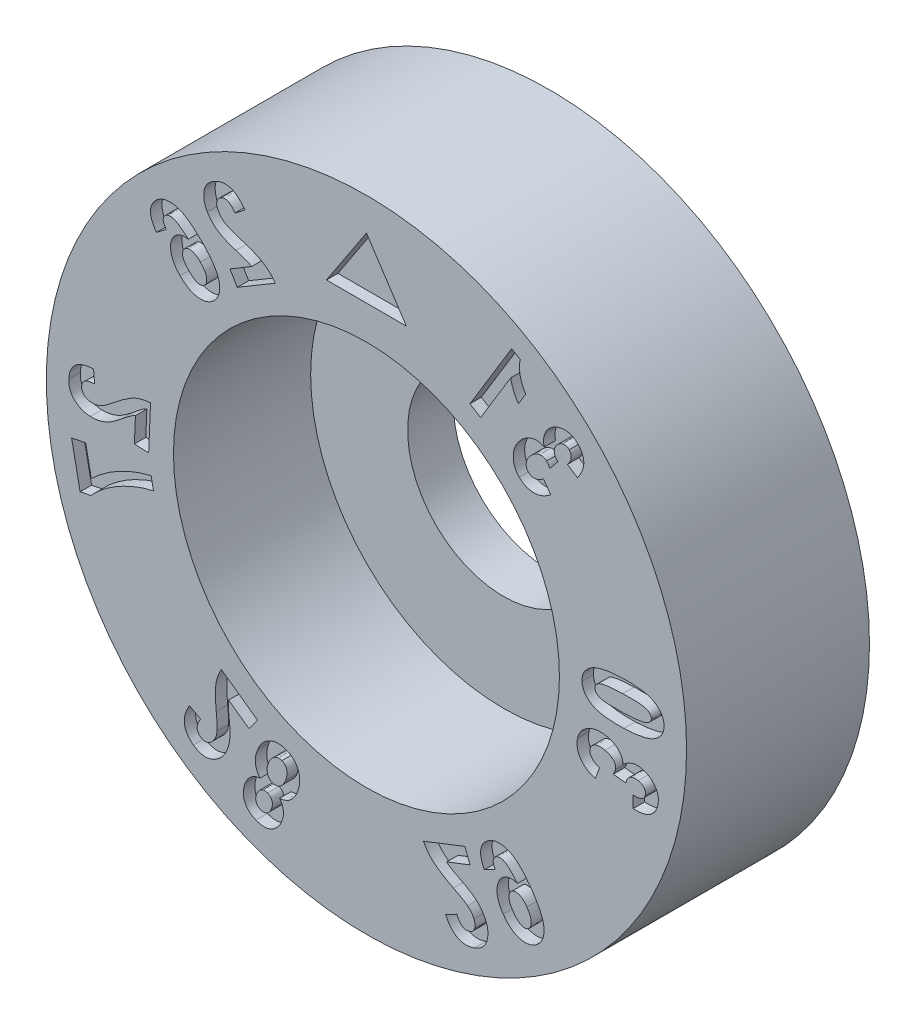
from build123d import *
from build123d.topology import SkipClean

# Parameters (mm, degrees)
SKETCH4_R           = 7
BOSS_EXTRUDE2_DEPTH = 4
SKETCH5_R           = 4.22
CUT_EXTRUDE2_DEPTH  = 3
SKETCH6_R           = 2.1
CUT_EXTRUDE3_DEPTH  = 11.344080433
CUT_EXTRUDE1_DEPTH  = 0.25
CUT_EXTRUDE4_DEPTH  = 0.25


with BuildPart() as part:
    # Sketch4 → Boss-Extrude2 (new body)
    with BuildSketch(Plane.XY):
        Circle(SKETCH4_R)
    extrude(amount=-BOSS_EXTRUDE2_DEPTH)

    # Sketch5 → Cut-Extrude2 (cut)
    with BuildSketch(Plane.XY):
        Circle(SKETCH5_R)
    extrude(amount=-CUT_EXTRUDE2_DEPTH, mode=Mode.SUBTRACT)

    # Sketch6 → Cut-Extrude3 (cut, through all)
    with BuildSketch(Plane.XY.offset(-3)):
        Circle(SKETCH6_R)
    extrude(amount=-CUT_EXTRUDE3_DEPTH, mode=Mode.SUBTRACT)

    # Sketch2 → Cut-Extrude1 (cut)
    # profile 1 of 12: a face of its own
    with BuildSketch(Plane.XY):
        with BuildLine():
            Line((-2.984728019, 4.112834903), (-2.824560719, 3.843310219))
            Line((-2.824560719, 3.843310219), (-1.990832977, 4.338826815))
            add(Edge.make_bspline(
                [(-1.990832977, 4.338826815), (-2.008826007, 4.362288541), (-2.044600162, 4.408935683), (-2.105880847, 4.472448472), (-2.17245835, 4.530291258), (-2.233360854, 4.573701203), (-2.287075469, 4.606151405), (-2.333329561, 4.630738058), (-2.385186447, 4.65562778), (-2.442680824, 4.680798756), (-2.50588008, 4.706020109), (-2.574435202, 4.732276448), (-2.649045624, 4.757983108), (-2.700719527, 4.775026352), (-2.727444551, 4.783840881)],
                knots=[0, 0, 0, 0, 1.212391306, 2.410504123, 3.613754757, 4.827069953, 5.473706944, 6.187701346, 6.975492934, 7.833422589, 8.76241682, 9.76734486, 10.845301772, 12, 12, 12, 12], degree=3))
            add(Edge.make_bspline(
                [(-2.727444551, 4.783840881), (-2.748411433, 4.790611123), (-2.78847163, 4.803546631), (-2.845382, 4.822803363), (-2.896255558, 4.840816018), (-2.941228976, 4.857234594), (-2.980554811, 4.871765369), (-3.013605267, 4.885950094), (-3.041064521, 4.89814691), (-3.057069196, 4.906438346), (-3.064220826, 4.910143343)],
                knots=[0, 0, 0, 0, 1.468696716, 2.806153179, 4.004802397, 5.066055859, 5.997852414, 6.798703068, 7.463204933, 8, 8, 8, 8], degree=3))
            add(Edge.make_bspline(
                [(-3.064220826, 4.910143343), (-3.0813605, 4.920364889), (-3.114872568, 4.940350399), (-3.159173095, 4.976984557), (-3.197584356, 5.017228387), (-3.217487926, 5.047715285), (-3.227345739, 5.062814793)],
                knots=[0, 0, 0, 0, 1.058555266, 2.069722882, 3.043975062, 4, 4, 4, 4], degree=3))
            add(Edge.make_bspline(
                [(-3.227345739, 5.062814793), (-3.236052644, 5.078662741), (-3.252476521, 5.108556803), (-3.268662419, 5.154525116), (-3.275991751, 5.197973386), (-3.27317593, 5.238552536), (-3.26277803, 5.275521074), (-3.24439642, 5.308381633), (-3.218588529, 5.337042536), (-3.196818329, 5.351309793), (-3.185577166, 5.358676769)],
                knots=[0, 0, 0, 0, 1.283647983, 2.421351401, 3.447956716, 4.392970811, 5.28922529, 6.15596118, 7.047820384, 8, 8, 8, 8], degree=3))
            add(Edge.make_bspline(
                [(-3.185577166, 5.358676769), (-3.172646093, 5.365496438), (-3.147936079, 5.378528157), (-3.107410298, 5.387088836), (-3.067014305, 5.385712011), (-3.027039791, 5.37288572), (-2.987685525, 5.350122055), (-2.948779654, 5.317415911), (-2.910438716, 5.274513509), (-2.886978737, 5.241342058), (-2.874527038, 5.223735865)],
                knots=[0, 0, 0, 0, 0.919227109, 1.75655281, 2.582056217, 3.443836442, 4.378099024, 5.436281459, 6.639271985, 8, 8, 8, 8], degree=3))
            Line((-2.874527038, 5.223735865), (-2.655854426, 5.392984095))
            add(Edge.make_bspline(
                [(-2.655854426, 5.392984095), (-2.668942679, 5.410535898), (-2.694259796, 5.44448703), (-2.734998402, 5.490793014), (-2.775530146, 5.532212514), (-2.816716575, 5.568065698), (-2.858257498, 5.598591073), (-2.900192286, 5.623570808), (-2.942579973, 5.643121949), (-2.985423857, 5.657070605), (-3.028573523, 5.665925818), (-3.071852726, 5.669899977), (-3.115403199, 5.66962435), (-3.159042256, 5.664185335), (-3.203011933, 5.654141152), (-3.246938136, 5.639105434), (-3.291346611, 5.619893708), (-3.319893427, 5.603682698), (-3.33449238, 5.595392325)],
                knots=[0, 0, 0, 0, 1.323054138, 2.559234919, 3.725090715, 4.824117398, 5.856378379, 6.837364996, 7.769835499, 8.672279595, 9.555076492, 10.427018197, 11.295104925, 12.182674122, 13.07999712, 14.016741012, 14.985753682, 16, 16, 16, 16], degree=3))
            add(Edge.make_bspline(
                [(-3.33449238, 5.595392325), (-3.349957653, 5.585648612), (-3.380144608, 5.566629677), (-3.42127951, 5.534400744), (-3.4568735, 5.499668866), (-3.487352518, 5.462990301), (-3.511743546, 5.423692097), (-3.531563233, 5.382692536), (-3.545262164, 5.339098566), (-3.553629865, 5.293909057), (-3.557316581, 5.248068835), (-3.558021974, 5.202541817), (-3.554455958, 5.15757701), (-3.546883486, 5.113365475), (-3.535534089, 5.069867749), (-3.520854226, 5.026910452), (-3.502149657, 4.984677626), (-3.486913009, 4.957634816), (-3.479222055, 4.943984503)],
                knots=[0, 0, 0, 0, 1.168449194, 2.280717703, 3.334275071, 4.343835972, 5.322236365, 6.285080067, 7.248607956, 8.234912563, 9.217987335, 10.186498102, 11.14394049, 12.098025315, 13.051359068, 14.015808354, 14.998445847, 16, 16, 16, 16], degree=3))
            add(Edge.make_bspline(
                [(-3.479222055, 4.943984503), (-3.469756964, 4.92871213), (-3.451023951, 4.898485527), (-3.418875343, 4.855940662), (-3.384540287, 4.815732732), (-3.346865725, 4.778272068), (-3.306549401, 4.742771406), (-3.262393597, 4.709638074), (-3.215022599, 4.678123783), (-3.172513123, 4.653750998), (-3.135808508, 4.634704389), (-3.104746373, 4.620467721), (-3.070814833, 4.605483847), (-3.033597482, 4.590718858), (-2.99359019, 4.575241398), (-2.950317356, 4.559930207), (-2.903931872, 4.544422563), (-2.871859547, 4.534108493), (-2.855349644, 4.528799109)],
                knots=[0, 0, 0, 0, 1.121400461, 2.219440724, 3.325906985, 4.420433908, 5.534012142, 6.67760351, 7.864746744, 9.084686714, 9.735298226, 10.446257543, 11.217836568, 12.051231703, 12.946049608, 13.896326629, 14.917089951, 16, 16, 16, 16], degree=3))
            add(Edge.make_bspline(
                [(-2.855349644, 4.528799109), (-2.840108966, 4.523865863), (-2.810997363, 4.514442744), (-2.7694884, 4.501107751), (-2.732106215, 4.489231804), (-2.699451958, 4.477357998), (-2.670514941, 4.468156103), (-2.646190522, 4.459282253), (-2.626125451, 4.451524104), (-2.596401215, 4.440056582), (-2.558144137, 4.421903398), (-2.527003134, 4.402842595), (-2.51204712, 4.39368831)],
                knots=[0, 0, 0, 0, 1.298684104, 2.48064936, 3.534690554, 4.478127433, 5.296983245, 5.995946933, 6.576831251, 7.041046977, 8.578910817, 10, 10, 10, 10], degree=3))
            Line((-2.51204712, 4.39368831), (-2.984728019, 4.112834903))
        make_face()
    # profile 2 of 12: a face of its own
    with BuildSketch(Plane.XY):
        with BuildLine():
            Line((-4.591280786, 4.001573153), (-4.376312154, 4.163287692))
            add(Edge.make_bspline(
                [(-4.376312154, 4.163287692), (-4.385789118, 4.175524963), (-4.403691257, 4.198641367), (-4.424163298, 4.234772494), (-4.438481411, 4.268890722), (-4.445375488, 4.301557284), (-4.445574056, 4.332651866), (-4.438130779, 4.362059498), (-4.423346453, 4.389596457), (-4.409165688, 4.405240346), (-4.401794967, 4.413371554)],
                knots=[0, 0, 0, 0, 1.325802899, 2.504463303, 3.550849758, 4.486766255, 5.349698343, 6.194283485, 7.061444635, 8, 8, 8, 8], degree=3))
            add(Edge.make_bspline(
                [(-4.401794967, 4.413371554), (-4.396421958, 4.418327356), (-4.385752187, 4.428168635), (-4.367183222, 4.439508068), (-4.347341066, 4.448243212), (-4.325907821, 4.453839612), (-4.303094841, 4.457221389), (-4.278760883, 4.456802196), (-4.253064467, 4.454433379), (-4.225638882, 4.448399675), (-4.195492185, 4.438516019), (-4.162698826, 4.422645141), (-4.12613826, 4.402077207), (-4.086709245, 4.375521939), (-4.043293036, 4.344303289), (-3.996851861, 4.307112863), (-3.946694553, 4.264774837), (-3.912676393, 4.234118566), (-3.894906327, 4.21810465)],
                knots=[0, 0, 0, 0, 0.589532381, 1.17069885, 1.748706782, 2.336139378, 2.955873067, 3.606516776, 4.297746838, 5.038885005, 5.871016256, 6.856025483, 7.977681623, 9.259586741, 10.695472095, 12.299036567, 14.06672778, 16, 16, 16, 16], degree=3))
            add(Edge.make_bspline(
                [(-3.894906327, 4.21810465), (-3.909396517, 4.220569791), (-3.937442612, 4.225341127), (-3.978985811, 4.226746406), (-4.018244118, 4.224940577), (-4.055403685, 4.218010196), (-4.09029572, 4.206355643), (-4.123063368, 4.190481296), (-4.153818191, 4.1701176), (-4.171997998, 4.153416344), (-4.181268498, 4.144899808)],
                knots=[0, 0, 0, 0, 1.142491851, 2.211319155, 3.22719952, 4.195445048, 5.142203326, 6.081403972, 7.021642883, 8, 8, 8, 8], degree=3))
            add(Edge.make_bspline(
                [(-4.181268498, 4.144899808), (-4.19085292, 4.134883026), (-4.209894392, 4.11498258), (-4.232935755, 4.080803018), (-4.25223138, 4.044622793), (-4.267282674, 4.005943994), (-4.276987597, 3.964362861), (-4.28256866, 3.920421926), (-4.284022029, 3.87393504), (-4.280727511, 3.825516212), (-4.273296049, 3.775811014), (-4.259921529, 3.726245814), (-4.242224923, 3.676883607), (-4.219104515, 3.628096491), (-4.190361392, 3.580101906), (-4.157426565, 3.532073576), (-4.118878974, 3.484872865), (-4.090322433, 3.45472931), (-4.075694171, 3.439288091)],
                knots=[0, 0, 0, 0, 0.839031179, 1.666912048, 2.48842499, 3.321544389, 4.174542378, 5.069945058, 6.002857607, 6.989051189, 8.008261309, 9.044156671, 10.095616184, 11.183464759, 12.310710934, 13.48348851, 14.710901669, 16, 16, 16, 16], degree=3))
            add(Edge.make_bspline(
                [(-4.075694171, 3.439288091), (-4.059547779, 3.423565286), (-4.028088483, 3.392931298), (-3.979050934, 3.351263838), (-3.929002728, 3.316219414), (-3.879145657, 3.285805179), (-3.828873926, 3.261048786), (-3.777917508, 3.242426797), (-3.726795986, 3.228924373), (-3.675558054, 3.221446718), (-3.62527733, 3.219336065), (-3.576785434, 3.221501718), (-3.530311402, 3.229000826), (-3.48596048, 3.241524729), (-3.443400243, 3.258617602), (-3.403067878, 3.280969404), (-3.364599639, 3.308100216), (-3.341429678, 3.329725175), (-3.329659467, 3.340710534)],
                knots=[0, 0, 0, 0, 1.283436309, 2.500620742, 3.659990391, 4.759643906, 5.824289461, 6.845596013, 7.844676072, 8.830590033, 9.788301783, 10.70718861, 11.590592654, 12.462994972, 13.326994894, 14.196657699, 15.083912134, 16, 16, 16, 16], degree=3))
            add(Edge.make_bspline(
                [(-3.329659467, 3.340710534), (-3.31746161, 3.353456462), (-3.293374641, 3.378625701), (-3.264351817, 3.421611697), (-3.241397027, 3.467262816), (-3.223977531, 3.515692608), (-3.213323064, 3.567396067), (-3.209067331, 3.621944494), (-3.210908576, 3.679311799), (-3.218275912, 3.73978243), (-3.233842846, 3.803259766), (-3.258395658, 3.869515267), (-3.292675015, 3.938201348), (-3.335409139, 4.009926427), (-3.387143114, 4.084553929), (-3.448424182, 4.161589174), (-3.518182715, 4.242157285), (-3.569391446, 4.295193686), (-3.595966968, 4.322717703)],
                knots=[0, 0, 0, 0, 0.744951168, 1.471046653, 2.182976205, 2.901631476, 3.640859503, 4.408358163, 5.210028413, 6.064471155, 6.979903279, 7.967133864, 9.046173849, 10.221478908, 11.495247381, 12.882905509, 14.382338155, 16, 16, 16, 16], degree=3))
            add(Edge.make_bspline(
                [(-3.595966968, 4.322717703), (-3.623622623, 4.350013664), (-3.676958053, 4.402655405), (-3.757396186, 4.475316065), (-3.835648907, 4.538178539), (-3.911258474, 4.591877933), (-3.984045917, 4.636724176), (-4.054227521, 4.672463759), (-4.122068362, 4.698339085), (-4.187218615, 4.715392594), (-4.249717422, 4.723646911), (-4.309301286, 4.725899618), (-4.366297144, 4.72168494), (-4.4205063, 4.710331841), (-4.471960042, 4.692698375), (-4.520502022, 4.668144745), (-4.566471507, 4.637359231), (-4.593808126, 4.612040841), (-4.607659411, 4.599212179)],
                knots=[0, 0, 0, 0, 1.589703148, 3.065828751, 4.432708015, 5.694068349, 6.857732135, 7.927774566, 8.911299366, 9.822828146, 10.676435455, 11.485348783, 12.258806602, 13.008410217, 13.745328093, 14.47750423, 15.2285614, 16, 16, 16, 16], degree=3))
            add(Edge.make_bspline(
                [(-4.607659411, 4.599212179), (-4.616780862, 4.589829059), (-4.634639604, 4.571458), (-4.657550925, 4.541140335), (-4.677448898, 4.509858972), (-4.693575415, 4.476973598), (-4.706326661, 4.442924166), (-4.715328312, 4.407567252), (-4.721481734, 4.370956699), (-4.723206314, 4.333017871), (-4.722013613, 4.293921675), (-4.715554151, 4.254145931), (-4.705549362, 4.21353927), (-4.691102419, 4.172349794), (-4.672452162, 4.130415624), (-4.6496392, 4.087793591), (-4.622390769, 4.044522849), (-4.601865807, 4.016186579), (-4.591280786, 4.001573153)],
                knots=[0, 0, 0, 0, 0.949785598, 1.859569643, 2.754728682, 3.639418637, 4.515162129, 5.39111668, 6.286151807, 7.206882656, 8.145587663, 9.122430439, 10.127772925, 11.180539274, 12.288603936, 13.458725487, 14.68942789, 16, 16, 16, 16], degree=3))
        make_face()
        with BuildLine():
            add(Edge.make_bspline(
                [(-3.631222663, 3.916623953), (-3.621927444, 3.906860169), (-3.603839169, 3.887860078), (-3.57920605, 3.858749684), (-3.557303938, 3.830278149), (-3.538920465, 3.801927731), (-3.52367573, 3.773848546), (-3.511248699, 3.746403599), (-3.501821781, 3.719315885), (-3.495944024, 3.692725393), (-3.492924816, 3.667081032), (-3.491688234, 3.642833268), (-3.493026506, 3.620082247), (-3.496983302, 3.59895043), (-3.502982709, 3.57936949), (-3.510999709, 3.561211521), (-3.521703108, 3.544700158), (-3.530613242, 3.535227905), (-3.535106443, 3.530451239)],
                knots=[0, 0, 0, 0, 1.474244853, 2.868845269, 4.169078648, 5.400786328, 6.560285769, 7.660816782, 8.692881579, 9.69151327, 10.632676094, 11.514622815, 12.344167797, 13.118960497, 13.860589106, 14.579724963, 15.283783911, 16, 16, 16, 16], degree=3))
            add(Edge.make_bspline(
                [(-3.535106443, 3.530451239), (-3.544548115, 3.522320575), (-3.563124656, 3.506323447), (-3.598198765, 3.49246145), (-3.636739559, 3.487553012), (-3.671121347, 3.490973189), (-3.700030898, 3.498439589), (-3.723581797, 3.506980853), (-3.747835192, 3.519382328), (-3.773172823, 3.534655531), (-3.799075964, 3.5534659), (-3.826303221, 3.574873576), (-3.854194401, 3.599812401), (-3.87249822, 3.618143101), (-3.881964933, 3.627623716)],
                knots=[0, 0, 0, 0, 1.110594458, 2.185100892, 3.322901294, 4.568376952, 5.255734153, 5.997557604, 6.809352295, 7.694056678, 8.647935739, 9.677522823, 10.798817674, 12, 12, 12, 12], degree=3))
            add(Edge.make_bspline(
                [(-3.881964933, 3.627623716), (-3.891579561, 3.637655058), (-3.910125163, 3.657004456), (-3.935906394, 3.686117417), (-3.957646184, 3.714956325), (-3.976665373, 3.742610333), (-3.992153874, 3.769504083), (-4.00496901, 3.795387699), (-4.013695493, 3.820766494), (-4.019501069, 3.845148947), (-4.022197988, 3.868442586), (-4.023103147, 3.8905661), (-4.021430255, 3.911558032), (-4.017066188, 3.931235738), (-4.010839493, 3.949862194), (-4.001813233, 3.967124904), (-3.991057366, 3.983595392), (-3.981895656, 3.993036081), (-3.977271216, 3.997801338)],
                knots=[0, 0, 0, 0, 1.566415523, 3.021450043, 4.38023524, 5.635199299, 6.802312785, 7.876475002, 8.885417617, 9.820727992, 10.696355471, 11.524644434, 12.313741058, 13.062189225, 13.792210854, 14.520278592, 15.253099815, 16, 16, 16, 16], degree=3))
            add(Edge.make_bspline(
                [(-3.977271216, 3.997801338), (-3.967458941, 4.006135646), (-3.948027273, 4.022640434), (-3.911679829, 4.037666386), (-3.871155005, 4.043125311), (-3.835005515, 4.040284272), (-3.804684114, 4.033419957), (-3.781007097, 4.025006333), (-3.756709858, 4.01429069), (-3.732250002, 4.000374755), (-3.707493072, 3.983387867), (-3.682388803, 3.963665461), (-3.656203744, 3.941829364), (-3.639715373, 3.925192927), (-3.631222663, 3.916623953)],
                knots=[0, 0, 0, 0, 1.165792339, 2.308668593, 3.519902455, 4.857671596, 5.584395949, 6.343983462, 7.140259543, 7.998186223, 8.90040815, 9.869826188, 10.902805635, 12, 12, 12, 12], degree=3))
        make_face(mode=Mode.SUBTRACT)
    # profile 3 of 12: a face of its own
    with BuildSketch(Plane.XY):
        with BuildLine():
            Line((-5.074667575, -0.248417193), (-4.761775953, -0.261415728))
            Line((-4.761775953, -0.261415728), (-4.721286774, 0.707070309))
            add(Edge.make_bspline(
                [(-4.721286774, 0.707070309), (-4.750700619, 0.704966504), (-4.809444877, 0.700764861), (-4.89608469, 0.683700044), (-4.981069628, 0.659673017), (-5.050646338, 0.632433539), (-5.106972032, 0.604973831), (-5.152731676, 0.5798159), (-5.201912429, 0.550191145), (-5.254262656, 0.515706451), (-5.310098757, 0.477002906), (-5.369056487, 0.433385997), (-5.431546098, 0.385426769), (-5.473932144, 0.351391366), (-5.495804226, 0.333828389)],
                knots=[0, 0, 0, 0, 1.210100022, 2.416767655, 3.618479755, 4.833802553, 5.479107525, 6.191017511, 6.977694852, 7.836418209, 8.765099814, 9.767552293, 10.848010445, 12, 12, 12, 12], degree=3))
            add(Edge.make_bspline(
                [(-5.495804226, 0.333828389), (-5.513029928, 0.320109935), (-5.545910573, 0.29392397), (-5.592715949, 0.256432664), (-5.635689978, 0.223798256), (-5.673991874, 0.194923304), (-5.708133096, 0.170491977), (-5.737698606, 0.150079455), (-5.762841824, 0.133817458), (-5.778629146, 0.125206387), (-5.785663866, 0.121369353)],
                knots=[0, 0, 0, 0, 1.469048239, 2.804138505, 4.000366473, 5.068631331, 6.003939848, 6.800677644, 7.465590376, 8, 8, 8, 8], degree=3))
            add(Edge.make_bspline(
                [(-5.785663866, 0.121369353), (-5.803636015, 0.112559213), (-5.838748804, 0.095346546), (-5.893858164, 0.078652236), (-5.948528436, 0.068080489), (-5.984973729, 0.068302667), (-6.003001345, 0.068412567)],
                knots=[0, 0, 0, 0, 1.060032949, 2.07102194, 3.045833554, 4, 4, 4, 4], degree=3))
            add(Edge.make_bspline(
                [(-6.003001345, 0.068412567), (-6.020987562, 0.069616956), (-6.05504094, 0.071897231), (-6.102164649, 0.083877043), (-6.142592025, 0.101341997), (-6.175159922, 0.125700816), (-6.199853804, 0.155217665), (-6.217595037, 0.188277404), (-6.227167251, 0.225572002), (-6.227561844, 0.251454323), (-6.227766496, 0.264877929)],
                knots=[0, 0, 0, 0, 1.280782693, 2.424910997, 3.442825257, 4.396654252, 5.290310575, 6.162051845, 7.046766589, 8, 8, 8, 8], degree=3))
            add(Edge.make_bspline(
                [(-6.227766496, 0.264877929), (-6.22639054, 0.279333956), (-6.223735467, 0.307228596), (-6.208620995, 0.345797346), (-6.185113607, 0.378592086), (-6.152929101, 0.405231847), (-6.112358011, 0.425702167), (-6.063601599, 0.439993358), (-6.00691352, 0.449460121), (-5.966312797, 0.450595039), (-5.944787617, 0.451196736)],
                knots=[0, 0, 0, 0, 0.914283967, 1.764220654, 2.582856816, 3.439909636, 4.378125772, 5.435421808, 6.640344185, 8, 8, 8, 8], degree=3))
            Line((-5.944787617, 0.451196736), (-5.966684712, 0.727168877))
            add(Edge.make_bspline(
                [(-5.966684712, 0.727168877), (-5.988475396, 0.725729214), (-6.030729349, 0.722937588), (-6.091867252, 0.714718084), (-6.148439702, 0.702805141), (-6.200954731, 0.688109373), (-6.249004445, 0.669882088), (-6.293087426, 0.648743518), (-6.332470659, 0.623825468), (-6.367677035, 0.595648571), (-6.398469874, 0.564192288), (-6.425963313, 0.53045707), (-6.449109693, 0.493586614), (-6.468590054, 0.454051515), (-6.484407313, 0.411844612), (-6.495927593, 0.366838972), (-6.504191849, 0.319247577), (-6.506147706, 0.286440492), (-6.507148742, 0.269649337)],
                knots=[0, 0, 0, 0, 1.320394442, 2.560354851, 3.726633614, 4.814132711, 5.854677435, 6.830653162, 7.765547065, 8.666756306, 9.55120701, 10.422789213, 11.293636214, 12.177623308, 13.084218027, 14.013917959, 14.983493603, 16, 16, 16, 16], degree=3))
            add(Edge.make_bspline(
                [(-6.507148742, 0.269649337), (-6.507551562, 0.251345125), (-6.508335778, 0.215710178), (-6.503251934, 0.163749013), (-6.494191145, 0.114931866), (-6.479763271, 0.069416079), (-6.460542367, 0.027283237), (-6.436481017, -0.011466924), (-6.407934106, -0.047089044), (-6.374688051, -0.07886096), (-6.338267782, -0.107046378), (-6.300133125, -0.132130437), (-6.260505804, -0.153760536), (-6.219580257, -0.172051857), (-6.176991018, -0.186394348), (-6.132980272, -0.197213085), (-6.087396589, -0.20498798), (-6.05637243, -0.20684554), (-6.040646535, -0.207787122)],
                knots=[0, 0, 0, 0, 1.169449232, 2.276703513, 3.330652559, 4.338217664, 5.320897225, 6.283413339, 7.246761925, 8.231187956, 9.215526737, 10.187219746, 11.146070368, 12.098479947, 13.049144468, 14.014511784, 14.993572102, 16, 16, 16, 16], degree=3))
            add(Edge.make_bspline(
                [(-6.040646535, -0.207787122), (-6.022713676, -0.208160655), (-5.987184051, -0.208900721), (-5.934099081, -0.205467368), (-5.8818015, -0.198181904), (-5.829930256, -0.18713595), (-5.778253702, -0.172701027), (-5.726433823, -0.154100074), (-5.674388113, -0.13152437), (-5.630771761, -0.109252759), (-5.594751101, -0.08898139), (-5.565753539, -0.070973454), (-5.534703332, -0.050811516), (-5.501764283, -0.028059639), (-5.467353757, -0.002323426), (-5.430526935, 0.025126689), (-5.391960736, 0.055365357), (-5.365798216, 0.076679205), (-5.352297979, 0.087677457)],
                knots=[0, 0, 0, 0, 1.120422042, 2.219845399, 3.319791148, 4.417222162, 5.531400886, 6.670011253, 7.854798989, 9.073997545, 9.728469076, 10.437086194, 11.206484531, 12.041787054, 12.938008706, 13.891350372, 14.911906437, 16, 16, 16, 16], degree=3))
            add(Edge.make_bspline(
                [(-5.352297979, 0.087677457), (-5.339899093, 0.097772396), (-5.316269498, 0.117011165), (-5.282667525, 0.144563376), (-5.25187841, 0.168674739), (-5.224520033, 0.189974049), (-5.200773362, 0.208831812), (-5.180195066, 0.224557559), (-5.162760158, 0.237245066), (-5.136630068, 0.255695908), (-5.100480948, 0.277669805), (-5.067466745, 0.29321593), (-5.051702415, 0.300639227)],
                knots=[0, 0, 0, 0, 1.297993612, 2.473694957, 3.527458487, 4.472565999, 5.288411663, 5.989114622, 6.574899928, 7.038751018, 8.585999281, 10, 10, 10, 10], degree=3))
            Line((-5.051702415, 0.300639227), (-5.074667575, -0.248417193))
        make_face()
    # profile 4 of 12: a face of its own
    with BuildSketch(Plane.XY):
        with BuildLine():
            Line((-6.14011454, -0.757535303), (-6.447364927, -0.81929791))
            Line((-6.447364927, -0.81929791), (-6.260667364, -1.746234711))
            Line((-6.260667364, -1.746234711), (-6.020517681, -1.698044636))
            add(Edge.make_bspline(
                [(-6.020517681, -1.698044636), (-6.010515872, -1.685977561), (-5.98982767, -1.661017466), (-5.955475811, -1.62459086), (-5.917775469, -1.587093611), (-5.876760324, -1.548603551), (-5.831553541, -1.509725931), (-5.783028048, -1.469845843), (-5.731304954, -1.428549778), (-5.656653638, -1.373197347), (-5.558468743, -1.305366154), (-5.434426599, -1.229681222), (-5.304271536, -1.160203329), (-5.192218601, -1.107063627), (-5.101203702, -1.067759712), (-5.033891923, -1.040580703), (-4.967743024, -1.015818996), (-4.902853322, -0.993597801), (-4.83927938, -0.973430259), (-4.777030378, -0.955127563), (-4.715903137, -0.939866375), (-4.675405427, -0.931188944), (-4.655517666, -0.9269276)],
                knots=[0, 0, 0, 0, 0.590488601, 1.221393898, 1.885711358, 2.594177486, 3.34038145, 4.132074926, 4.961089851, 5.834152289, 7.633661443, 9.456176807, 11.30660703, 13.190894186, 14.127666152, 15.042190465, 15.926113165, 16.788962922, 17.626537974, 18.439325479, 19.233578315, 20, 20, 20, 20], degree=3))
            Line((-4.655517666, -0.9269276), (-4.708226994, -0.665949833))
            add(Edge.make_bspline(
                [(-4.708226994, -0.665949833), (-4.738640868, -0.673241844), (-4.799439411, -0.687818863), (-4.889784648, -0.713450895), (-4.979218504, -0.742858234), (-5.068261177, -0.774563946), (-5.15625347, -0.810384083), (-5.243932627, -0.848464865), (-5.330673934, -0.890567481), (-5.416566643, -0.935357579), (-5.500480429, -0.983152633), (-5.582471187, -1.032440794), (-5.66154586, -1.084054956), (-5.737521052, -1.138318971), (-5.811420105, -1.193670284), (-5.882173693, -1.251853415), (-5.950670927, -1.311462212), (-5.994150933, -1.353235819), (-6.015763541, -1.374000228)],
                knots=[0, 0, 0, 0, 0.99744444, 1.993931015, 2.994072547, 3.999699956, 5.007825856, 6.023501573, 7.047980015, 8.08229609, 9.112518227, 10.127492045, 11.133091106, 12.12324261, 13.104828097, 14.077207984, 15.044237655, 16, 16, 16, 16], degree=3))
            Line((-6.015763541, -1.374000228), (-6.14011454, -0.757535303))
        make_face()
    # profile 5 of 12: a face of its own
    with BuildSketch(Plane.XY):
        with BuildLine():
            Line((-2.565622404, -4.385757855), (-2.383369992, -4.130588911))
            Line((-2.383369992, -4.130588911), (-3.173150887, -3.566607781))
            add(Edge.make_bspline(
                [(-3.173150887, -3.566607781), (-3.187612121, -3.59233073), (-3.216434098, -3.643597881), (-3.249239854, -3.725537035), (-3.275948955, -3.809748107), (-3.290645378, -3.883124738), (-3.299081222, -3.945466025), (-3.302539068, -3.997750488), (-3.304815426, -4.055246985), (-3.304651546, -4.117954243), (-3.302315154, -4.185932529), (-3.298208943, -4.259244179), (-3.292451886, -4.337919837), (-3.287008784, -4.392056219), (-3.284196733, -4.420024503)],
                knots=[0, 0, 0, 0, 1.209363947, 2.410324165, 3.612765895, 4.829526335, 5.474513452, 6.192476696, 6.977960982, 7.83484588, 8.764167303, 9.768041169, 10.846911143, 12, 12, 12, 12], degree=3))
            add(Edge.make_bspline(
                [(-3.284196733, -4.420024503), (-3.282036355, -4.441939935), (-3.277901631, -4.483883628), (-3.272771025, -4.543785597), (-3.268698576, -4.597665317), (-3.265272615, -4.645536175), (-3.263648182, -4.687474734), (-3.263133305, -4.723519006), (-3.262886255, -4.75347648), (-3.264341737, -4.771416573), (-3.264985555, -4.779352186)],
                knots=[0, 0, 0, 0, 1.467247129, 2.808147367, 4.005621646, 5.067418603, 6.00565306, 6.801285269, 7.469760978, 8, 8, 8, 8], degree=3))
            add(Edge.make_bspline(
                [(-3.264985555, -4.779352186), (-3.267519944, -4.79922185), (-3.272461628, -4.837964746), (-3.287482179, -4.89362636), (-3.309531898, -4.944854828), (-3.329300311, -4.975594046), (-3.339085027, -4.99080895)],
                knots=[0, 0, 0, 0, 1.05998413, 2.066811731, 3.043135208, 4, 4, 4, 4], degree=3))
            add(Edge.make_bspline(
                [(-3.339085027, -4.99080895), (-3.350022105, -5.005179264), (-3.37069919, -5.032347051), (-3.406384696, -5.065493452), (-3.443039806, -5.089822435), (-3.481217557, -5.10366038), (-3.519340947, -5.108339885), (-3.556796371, -5.104466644), (-3.593678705, -5.092755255), (-3.615570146, -5.078494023), (-3.62686709, -5.071134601)],
                knots=[0, 0, 0, 0, 1.281327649, 2.422413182, 3.444562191, 4.386852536, 5.281056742, 6.150587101, 7.045621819, 8, 8, 8, 8], degree=3))
            add(Edge.make_bspline(
                [(-3.62686709, -5.071134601), (-3.638280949, -5.062118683), (-3.660207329, -5.044798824), (-3.683892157, -5.010865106), (-3.698907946, -4.973462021), (-3.703418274, -4.93174513), (-3.698035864, -4.886768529), (-3.683681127, -4.838192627), (-3.660240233, -4.785872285), (-3.639229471, -4.751130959), (-3.628065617, -4.73267151)],
                knots=[0, 0, 0, 0, 0.915953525, 1.759575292, 2.584267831, 3.442131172, 4.383692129, 5.432886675, 6.635990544, 8, 8, 8, 8], degree=3))
            Line((-3.628065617, -4.73267151), (-3.871518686, -4.60007985))
            add(Edge.make_bspline(
                [(-3.871518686, -4.60007985), (-3.882214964, -4.619157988), (-3.902903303, -4.656058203), (-3.928997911, -4.711914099), (-3.950653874, -4.765618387), (-3.966900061, -4.81777292), (-3.977409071, -4.868170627), (-3.983893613, -4.916567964), (-3.984538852, -4.963301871), (-3.980125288, -5.008137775), (-3.971185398, -5.051270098), (-3.957303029, -5.092590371), (-3.939333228, -5.132258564), (-3.91670606, -5.170116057), (-3.890231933, -5.206484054), (-3.858568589, -5.240554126), (-3.823031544, -5.273315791), (-3.796714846, -5.293079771), (-3.783239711, -5.303199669)],
                knots=[0, 0, 0, 0, 1.321455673, 2.555909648, 3.722935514, 4.819044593, 5.852080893, 6.8311177, 7.765651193, 8.669704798, 9.549050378, 10.421853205, 11.298838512, 12.175736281, 13.083039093, 14.012080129, 14.982110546, 16, 16, 16, 16], degree=3))
            add(Edge.make_bspline(
                [(-3.783239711, -5.303199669), (-3.768124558, -5.313546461), (-3.73862603, -5.333739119), (-3.692280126, -5.357930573), (-3.646324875, -5.376872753), (-3.600355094, -5.389550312), (-3.554618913, -5.396544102), (-3.508922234, -5.398203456), (-3.463416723, -5.393507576), (-3.418639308, -5.38283015), (-3.375215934, -5.367723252), (-3.333213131, -5.349860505), (-3.293565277, -5.328240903), (-3.255874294, -5.303848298), (-3.220690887, -5.275872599), (-3.187451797, -5.244887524), (-3.156308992, -5.210670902), (-3.137605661, -5.185752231), (-3.128161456, -5.173169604)],
                knots=[0, 0, 0, 0, 1.169083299, 2.281567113, 3.332103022, 4.338705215, 5.319419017, 6.281329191, 7.251523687, 8.231800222, 9.214697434, 10.185422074, 11.143759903, 12.095483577, 13.04960681, 14.010744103, 14.995529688, 16, 16, 16, 16], degree=3))
            add(Edge.make_bspline(
                [(-3.128161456, -5.173169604), (-3.117994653, -5.158427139), (-3.097827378, -5.129183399), (-3.072030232, -5.082712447), (-3.04911084, -5.035189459), (-3.029653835, -4.98582151), (-3.013847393, -4.93436982), (-3.000919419, -4.880779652), (-2.991515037, -4.824709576), (-2.98638844, -4.776000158), (-2.983557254, -4.734635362), (-2.983098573, -4.700385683), (-2.982770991, -4.663276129), (-2.984441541, -4.623121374), (-2.986196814, -4.580062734), (-2.989659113, -4.53412495), (-2.993903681, -4.485297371), (-2.997461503, -4.451777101), (-2.999295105, -4.434501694)],
                knots=[0, 0, 0, 0, 1.117086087, 2.215896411, 3.312966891, 4.408369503, 5.524013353, 6.669705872, 7.846558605, 9.06944417, 9.725247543, 10.433429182, 11.206744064, 12.041033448, 12.941153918, 13.896258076, 14.915790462, 16, 16, 16, 16], degree=3))
            add(Edge.make_bspline(
                [(-2.999295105, -4.434501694), (-3.001015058, -4.418570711), (-3.004288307, -4.388252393), (-3.008528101, -4.344930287), (-3.01212514, -4.305991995), (-3.014916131, -4.271335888), (-3.017290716, -4.241027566), (-3.019741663, -4.215176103), (-3.020475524, -4.193665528), (-3.021726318, -4.161785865), (-3.020835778, -4.119450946), (-3.015812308, -4.08324232), (-3.013410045, -4.065927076)],
                knots=[0, 0, 0, 0, 1.299416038, 2.472924, 3.529933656, 4.470514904, 5.292360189, 5.995469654, 6.575649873, 7.037213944, 8.583172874, 10, 10, 10, 10], degree=3))
            Line((-3.013410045, -4.065927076), (-2.565622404, -4.385757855))
        make_face()
    # profile 6 of 12: a face of its own
    with BuildSketch(Plane.XY):
        with BuildLine():
            add(Edge.make_bspline(
                [(-2.326280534, -5.200274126), (-2.344657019, -5.202614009), (-2.380675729, -5.207200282), (-2.431844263, -5.223664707), (-2.479252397, -5.24610485), (-2.522497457, -5.27559495), (-2.561345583, -5.312153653), (-2.596039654, -5.355124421), (-2.626485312, -5.404925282), (-2.642300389, -5.441568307), (-2.650481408, -5.460523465)],
                knots=[0, 0, 0, 0, 1.00968592, 1.979028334, 2.920160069, 3.865941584, 4.824339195, 5.822769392, 6.873735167, 8, 8, 8, 8], degree=3))
            add(Edge.make_bspline(
                [(-2.650481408, -5.460523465), (-2.656445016, -5.4762408), (-2.668085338, -5.50691935), (-2.68065529, -5.553426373), (-2.688891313, -5.598862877), (-2.692744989, -5.643190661), (-2.692637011, -5.686548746), (-2.687232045, -5.728713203), (-2.678259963, -5.769953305), (-2.664619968, -5.809783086), (-2.6467406, -5.847604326), (-2.625442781, -5.883334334), (-2.599989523, -5.916254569), (-2.570619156, -5.946557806), (-2.537305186, -5.97400044), (-2.500461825, -5.999095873), (-2.459873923, -6.021411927), (-2.430919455, -6.033796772), (-2.41614661, -6.040115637)],
                knots=[0, 0, 0, 0, 1.141772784, 2.22861787, 3.268241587, 4.275722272, 5.248471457, 6.208331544, 7.158707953, 8.112142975, 9.062144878, 9.996905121, 10.933186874, 11.883188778, 12.858594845, 13.860957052, 14.908639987, 16, 16, 16, 16], degree=3))
            add(Edge.make_bspline(
                [(-2.41614661, -6.040115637), (-2.400271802, -6.04611089), (-2.3693187, -6.057800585), (-2.322271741, -6.069843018), (-2.276738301, -6.077071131), (-2.232554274, -6.079221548), (-2.189756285, -6.076826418), (-2.148263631, -6.068723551), (-2.10812463, -6.056190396), (-2.069844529, -6.038410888), (-2.03380648, -6.016483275), (-1.999608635, -5.992009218), (-1.967911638, -5.964532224), (-1.939536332, -5.933482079), (-1.912605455, -5.900479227), (-1.889085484, -5.86388872), (-1.867897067, -5.824583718), (-1.85600849, -5.796853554), (-1.84997235, -5.782774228)],
                knots=[0, 0, 0, 0, 1.160064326, 2.261922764, 3.315350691, 4.308682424, 5.282650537, 6.239949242, 7.193164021, 8.152481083, 9.119049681, 10.075080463, 11.026642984, 11.982159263, 12.949134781, 13.937005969, 14.952564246, 16, 16, 16, 16], degree=3))
            add(Edge.make_bspline(
                [(-1.84997235, -5.782774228), (-1.84287891, -5.763407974), (-1.829089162, -5.725759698), (-1.817054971, -5.668144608), (-1.812471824, -5.612039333), (-1.815922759, -5.557658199), (-1.82668372, -5.505759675), (-1.843687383, -5.456888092), (-1.867745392, -5.411370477), (-1.888691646, -5.384462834), (-1.899275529, -5.370866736)],
                knots=[0, 0, 0, 0, 1.132440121, 2.201479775, 3.223738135, 4.218182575, 5.185632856, 6.128439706, 7.05432379, 8, 8, 8, 8], degree=3))
            add(Edge.make_bspline(
                [(-1.899275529, -5.370866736), (-1.877214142, -5.36853779), (-1.834120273, -5.363988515), (-1.772658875, -5.345849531), (-1.716242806, -5.319495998), (-1.664646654, -5.284522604), (-1.618390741, -5.240542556), (-1.577065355, -5.188134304), (-1.540075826, -5.127547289), (-1.520834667, -5.082684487), (-1.510864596, -5.059438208)],
                knots=[0, 0, 0, 0, 1.006379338, 1.965822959, 2.895773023, 3.826345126, 4.78530613, 5.784124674, 6.851813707, 8, 8, 8, 8], degree=3))
            add(Edge.make_bspline(
                [(-1.510864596, -5.059438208), (-1.501758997, -5.034768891), (-1.483992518, -4.986635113), (-1.467144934, -4.913058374), (-1.458715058, -4.841223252), (-1.459193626, -4.771520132), (-1.468210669, -4.704997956), (-1.484959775, -4.642425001), (-1.510366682, -4.584599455), (-1.543790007, -4.531970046), (-1.583711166, -4.48439825), (-1.63090019, -4.443709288), (-1.683384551, -4.408375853), (-1.722421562, -4.391415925), (-1.742234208, -4.38280817)],
                knots=[0, 0, 0, 0, 1.179244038, 2.300893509, 3.378325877, 4.419100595, 5.420568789, 6.383647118, 7.317063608, 8.243529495, 9.173446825, 10.093308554, 11.032287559, 12, 12, 12, 12], degree=3))
            add(Edge.make_bspline(
                [(-1.742234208, -4.38280817), (-1.75819056, -4.376897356), (-1.789465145, -4.36531211), (-1.837331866, -4.353417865), (-1.884750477, -4.346942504), (-1.931772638, -4.344906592), (-1.97840534, -4.348618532), (-2.024595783, -4.356799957), (-2.07032765, -4.370180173), (-2.115028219, -4.388754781), (-2.158371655, -4.411630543), (-2.199404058, -4.439136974), (-2.237119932, -4.471661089), (-2.272890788, -4.507755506), (-2.30467495, -4.549306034), (-2.334647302, -4.594626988), (-2.361455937, -4.644670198), (-2.376534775, -4.680245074), (-2.384237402, -4.698417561)],
                knots=[0, 0, 0, 0, 1.015462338, 1.990314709, 2.937645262, 3.869155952, 4.794829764, 5.724998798, 6.665688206, 7.633778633, 8.610499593, 9.587936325, 10.576072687, 11.579808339, 12.616449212, 13.693666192, 14.821870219, 16, 16, 16, 16], degree=3))
            add(Edge.make_bspline(
                [(-2.384237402, -4.698417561), (-2.39293724, -4.722325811), (-2.409813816, -4.768704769), (-2.425488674, -4.839201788), (-2.431653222, -4.907514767), (-2.428830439, -4.973296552), (-2.416963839, -5.036110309), (-2.39579293, -5.095253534), (-2.365841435, -5.150759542), (-2.339566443, -5.183645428), (-2.326280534, -5.200274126)],
                knots=[0, 0, 0, 0, 1.144645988, 2.220467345, 3.240948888, 4.22475199, 5.175786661, 6.107753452, 7.043188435, 8, 8, 8, 8], degree=3))
        make_face()
        with BuildLine():
            add(Edge.make_bspline(
                [(-2.399340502, -5.534778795), (-2.392851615, -5.520068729), (-2.380488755, -5.492042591), (-2.356452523, -5.455348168), (-2.32846754, -5.42640648), (-2.297089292, -5.405958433), (-2.264015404, -5.392633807), (-2.229822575, -5.387412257), (-2.195063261, -5.389598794), (-2.173002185, -5.39708042), (-2.161730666, -5.400902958)],
                knots=[0, 0, 0, 0, 1.25689766, 2.394685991, 3.413972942, 4.384780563, 5.304930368, 6.183321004, 7.071816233, 8, 8, 8, 8], degree=3))
            add(Edge.make_bspline(
                [(-2.161730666, -5.400902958), (-2.150848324, -5.405943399), (-2.129590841, -5.415789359), (-2.102595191, -5.438206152), (-2.080966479, -5.465641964), (-2.06571058, -5.498185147), (-2.056470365, -5.53486501), (-2.057123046, -5.575177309), (-2.06375986, -5.618599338), (-2.074380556, -5.647356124), (-2.079971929, -5.662495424)],
                knots=[0, 0, 0, 0, 0.930413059, 1.817461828, 2.702401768, 3.630026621, 4.596261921, 5.619528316, 6.746776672, 8, 8, 8, 8], degree=3))
            add(Edge.make_bspline(
                [(-2.079971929, -5.662495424), (-2.086296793, -5.676871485), (-2.09828752, -5.704125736), (-2.12201808, -5.739980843), (-2.149556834, -5.768494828), (-2.180901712, -5.788928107), (-2.213950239, -5.801687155), (-2.247859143, -5.807006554), (-2.282256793, -5.805212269), (-2.304038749, -5.797648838), (-2.315137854, -5.793794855)],
                knots=[0, 0, 0, 0, 1.243935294, 2.358262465, 3.391112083, 4.365701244, 5.302103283, 6.179013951, 7.072107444, 8, 8, 8, 8], degree=3))
            add(Edge.make_bspline(
                [(-2.315137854, -5.793794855), (-2.326287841, -5.788703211), (-2.348057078, -5.778762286), (-2.375385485, -5.755929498), (-2.397149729, -5.72833877), (-2.41259576, -5.695754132), (-2.421110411, -5.659059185), (-2.421498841, -5.6193276), (-2.414760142, -5.577118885), (-2.404641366, -5.549334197), (-2.399340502, -5.534778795)],
                knots=[0, 0, 0, 0, 0.95693597, 1.868322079, 2.75908117, 3.692805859, 4.670468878, 5.687178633, 6.788395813, 8, 8, 8, 8], degree=3))
        make_face(mode=Mode.SUBTRACT)
        with BuildLine():
            add(Edge.make_bspline(
                [(-2.144665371, -4.829244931), (-2.140172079, -4.818704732), (-2.131450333, -4.798245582), (-2.11731563, -4.769015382), (-2.10159247, -4.742784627), (-2.08514791, -4.71897457), (-2.067458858, -4.697924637), (-2.049240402, -4.678815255), (-2.029507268, -4.662724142), (-2.002606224, -4.645375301), (-1.968726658, -4.628781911), (-1.926870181, -4.619059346), (-1.885453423, -4.618819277), (-1.859799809, -4.62725938), (-1.846948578, -4.631487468)],
                knots=[0, 0, 0, 0, 1.036389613, 2.011693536, 2.933770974, 3.799884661, 4.62603231, 5.41839611, 6.18465062, 6.92216648, 8.311969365, 9.571035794, 10.783205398, 12, 12, 12, 12], degree=3))
            add(Edge.make_bspline(
                [(-1.846948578, -4.631487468), (-1.834668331, -4.637258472), (-1.810538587, -4.648598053), (-1.780871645, -4.676493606), (-1.757881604, -4.711024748), (-1.744628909, -4.744868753), (-1.737943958, -4.774703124), (-1.735317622, -4.799230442), (-1.735197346, -4.825137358), (-1.737627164, -4.852576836), (-1.742318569, -4.88138786), (-1.75021897, -4.911450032), (-1.759362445, -4.94336714), (-1.767723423, -4.964636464), (-1.772053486, -4.975651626)],
                knots=[0, 0, 0, 0, 1.233249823, 2.423241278, 3.66448134, 5.0001103, 5.717094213, 6.453875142, 7.249444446, 8.080543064, 8.968535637, 9.913029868, 10.919179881, 12, 12, 12, 12], degree=3))
            add(Edge.make_bspline(
                [(-1.772053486, -4.975651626), (-1.780035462, -4.993802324), (-1.795289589, -5.028489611), (-1.825179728, -5.074276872), (-1.859379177, -5.111543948), (-1.897819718, -5.139013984), (-1.938133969, -5.15765075), (-1.979174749, -5.166129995), (-2.020363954, -5.165844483), (-2.045995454, -5.157179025), (-2.059011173, -5.15277869)],
                knots=[0, 0, 0, 0, 1.263412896, 2.414472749, 3.471830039, 4.471626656, 5.409883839, 6.283512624, 7.128364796, 8, 8, 8, 8], degree=3))
            add(Edge.make_bspline(
                [(-2.059011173, -5.15277869), (-2.071300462, -5.147012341), (-2.09555574, -5.135631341), (-2.125213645, -5.107473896), (-2.148993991, -5.073083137), (-2.165057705, -5.031557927), (-2.173842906, -4.985207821), (-2.173268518, -4.935154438), (-2.163864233, -4.882318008), (-2.151267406, -4.847495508), (-2.144665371, -4.829244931)],
                knots=[0, 0, 0, 0, 0.869362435, 1.715854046, 2.596676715, 3.545131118, 4.560921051, 5.618161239, 6.751671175, 8, 8, 8, 8], degree=3))
        make_face(mode=Mode.SUBTRACT)
    # profile 7 of 12: a face of its own
    with BuildSketch(Plane.XY):
        with BuildLine():
            Line((2.266393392, -4.548380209), (2.152756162, -4.255766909))
            Line((2.152756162, -4.255766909), (1.247766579, -4.608035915))
            add(Edge.make_bspline(
                [(1.247766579, -4.608035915), (1.261575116, -4.63407192), (1.289124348, -4.686016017), (1.338667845, -4.759190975), (1.395712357, -4.826748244), (1.44833915, -4.87999669), (1.496192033, -4.920852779), (1.537586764, -4.953068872), (1.584939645, -4.985822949), (1.637254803, -5.020588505), (1.695399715, -5.056062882), (1.759093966, -5.092984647), (1.828352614, -5.130756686), (1.876569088, -5.156021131), (1.901409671, -5.169037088)],
                knots=[0, 0, 0, 0, 1.20751576, 2.40909909, 3.613657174, 4.827910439, 5.473104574, 6.191853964, 6.977105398, 7.832683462, 8.766474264, 9.768604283, 10.850410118, 12, 12, 12, 12], degree=3))
            add(Edge.make_bspline(
                [(1.901409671, -5.169037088), (1.921015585, -5.179143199), (1.958457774, -5.198443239), (2.011358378, -5.227030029), (2.058841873, -5.253017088), (2.100709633, -5.276565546), (2.136723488, -5.298079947), (2.167186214, -5.317029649), (2.192241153, -5.333539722), (2.20665069, -5.344449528), (2.213093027, -5.349327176)],
                knots=[0, 0, 0, 0, 1.468697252, 2.804829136, 4.003747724, 5.073058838, 6.003167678, 6.796787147, 7.462057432, 8, 8, 8, 8], degree=3))
            add(Edge.make_bspline(
                [(2.213093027, -5.349327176), (2.228429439, -5.362366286), (2.258305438, -5.387767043), (2.296314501, -5.431143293), (2.327601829, -5.47728224), (2.342189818, -5.510723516), (2.349434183, -5.527330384)],
                knots=[0, 0, 0, 0, 1.064025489, 2.072768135, 3.04294069, 4, 4, 4, 4], degree=3))
            add(Edge.make_bspline(
                [(2.349434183, -5.527330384), (2.355586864, -5.544345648), (2.367218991, -5.57651434), (2.375347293, -5.624588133), (2.375117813, -5.668606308), (2.366187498, -5.708379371), (2.348956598, -5.743091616), (2.325280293, -5.772630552), (2.295154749, -5.7970352), (2.271325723, -5.80763736), (2.259026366, -5.813109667)],
                knots=[0, 0, 0, 0, 1.280414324, 2.420723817, 3.435645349, 4.382832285, 5.283388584, 6.157930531, 7.049215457, 8, 8, 8, 8], degree=3))
            add(Edge.make_bspline(
                [(2.259026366, -5.813109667), (2.245174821, -5.817562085), (2.218558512, -5.826117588), (2.177132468, -5.828341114), (2.137579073, -5.819784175), (2.100333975, -5.800634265), (2.065120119, -5.771800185), (2.032320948, -5.732945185), (2.001350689, -5.684362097), (1.983968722, -5.647601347), (1.974703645, -5.628006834)],
                knots=[0, 0, 0, 0, 0.915144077, 1.758486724, 2.583206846, 3.438924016, 4.375749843, 5.436610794, 6.633641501, 8, 8, 8, 8], degree=3))
            Line((1.974703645, -5.628006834), (1.730324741, -5.759126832))
            add(Edge.make_bspline(
                [(1.730324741, -5.759126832), (1.74036946, -5.778566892), (1.759826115, -5.816222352), (1.791989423, -5.86881282), (1.825496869, -5.915986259), (1.859837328, -5.958438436), (1.896443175, -5.99479889), (1.933327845, -6.026997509), (1.972317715, -6.05286188), (2.012252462, -6.074039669), (2.053479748, -6.089834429), (2.095449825, -6.101476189), (2.138417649, -6.108174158), (2.182395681, -6.110002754), (2.227404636, -6.107499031), (2.273421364, -6.100085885), (2.320338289, -6.088027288), (2.351332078, -6.076950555), (2.367160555, -6.071293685)],
                knots=[0, 0, 0, 0, 1.321097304, 2.558969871, 3.718671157, 4.813835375, 5.851207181, 6.830923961, 7.765395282, 8.669857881, 9.555365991, 10.425976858, 11.295618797, 12.175105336, 13.079398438, 14.013186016, 14.985337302, 16, 16, 16, 16], degree=3))
            add(Edge.make_bspline(
                [(2.367160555, -6.071293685), (2.384155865, -6.064257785), (2.417239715, -6.050561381), (2.462897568, -6.024894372), (2.503986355, -5.996921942), (2.539980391, -5.965594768), (2.570826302, -5.930980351), (2.597159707, -5.89356178), (2.618254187, -5.852796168), (2.633902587, -5.809447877), (2.645353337, -5.76480083), (2.65287813, -5.719802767), (2.656678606, -5.674825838), (2.656663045, -5.629924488), (2.652847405, -5.585108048), (2.645227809, -5.540285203), (2.633712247, -5.495439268), (2.623107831, -5.466130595), (2.617748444, -5.451318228)],
                knots=[0, 0, 0, 0, 1.172713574, 2.282858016, 3.33496324, 4.339728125, 5.318961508, 6.28644466, 7.251773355, 8.238145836, 9.220635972, 10.189091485, 11.145783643, 12.09736416, 13.050591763, 14.012190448, 14.995377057, 16, 16, 16, 16], degree=3))
            add(Edge.make_bspline(
                [(2.617748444, -5.451318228), (2.61094641, -5.434716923), (2.597445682, -5.401766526), (2.572755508, -5.354559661), (2.5454849, -5.309152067), (2.51441715, -5.265947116), (2.480293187, -5.224167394), (2.442044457, -5.184410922), (2.400726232, -5.14536812), (2.363002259, -5.114058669), (2.329532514, -5.089522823), (2.301559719, -5.069708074), (2.270138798, -5.050004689), (2.236060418, -5.028962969), (2.198903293, -5.007259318), (2.158630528, -4.985012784), (2.115606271, -4.961457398), (2.085570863, -4.94617187), (2.070049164, -4.938272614)],
                knots=[0, 0, 0, 0, 1.118213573, 2.219438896, 3.318187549, 4.418695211, 5.534860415, 6.679202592, 7.856194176, 9.078602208, 9.732935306, 10.443897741, 11.215605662, 12.044995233, 12.941532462, 13.898565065, 14.914020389, 16, 16, 16, 16], degree=3))
            add(Edge.make_bspline(
                [(2.070049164, -4.938272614), (2.05578823, -4.930953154), (2.028634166, -4.917016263), (1.989968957, -4.896805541), (1.955087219, -4.878746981), (1.924215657, -4.862475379), (1.897734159, -4.847546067), (1.875085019, -4.834906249), (1.856224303, -4.824582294), (1.829176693, -4.807574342), (1.793923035, -4.784070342), (1.766441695, -4.75982365), (1.753271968, -4.748204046)],
                knots=[0, 0, 0, 0, 1.297728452, 2.470988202, 3.532080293, 4.477757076, 5.295979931, 5.992984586, 6.577870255, 7.035960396, 8.579560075, 10, 10, 10, 10], degree=3))
            Line((1.753271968, -4.748204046), (2.266393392, -4.548380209))
        make_face()
    # profile 8 of 12: a face of its own
    with BuildSketch(Plane.XY):
        with BuildLine():
            Line((2.577895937, -4.483753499), (2.816301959, -4.36049205))
            add(Edge.make_bspline(
                [(2.816301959, -4.36049205), (2.809160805, -4.346929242), (2.795683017, -4.321331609), (2.78064926, -4.28309797), (2.772765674, -4.247309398), (2.770945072, -4.214290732), (2.775892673, -4.183798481), (2.787894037, -4.156294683), (2.8064284, -4.131575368), (2.822928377, -4.11879113), (2.83146703, -4.112175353)],
                knots=[0, 0, 0, 0, 1.327730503, 2.505879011, 3.547436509, 4.490281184, 5.355385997, 6.198005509, 7.067477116, 8, 8, 8, 8], degree=3))
            add(Edge.make_bspline(
                [(2.83146703, -4.112175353), (2.837792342, -4.108149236), (2.850273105, -4.100205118), (2.870719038, -4.091560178), (2.891951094, -4.086003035), (2.914101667, -4.083791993), (2.937144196, -4.083853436), (2.960905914, -4.088495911), (2.985716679, -4.094923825), (3.01163741, -4.105242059), (3.039516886, -4.119860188), (3.068839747, -4.140965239), (3.101258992, -4.16703696), (3.135639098, -4.199525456), (3.173224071, -4.237180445), (3.212530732, -4.281356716), (3.255342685, -4.330569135), (3.283677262, -4.366206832), (3.298486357, -4.38483291)],
                knots=[0, 0, 0, 0, 0.606994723, 1.197689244, 1.791260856, 2.379220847, 2.998307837, 3.6514862, 4.335247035, 5.074405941, 5.907677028, 6.880641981, 7.997438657, 9.278921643, 10.71261893, 12.309548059, 14.07118168, 16, 16, 16, 16], degree=3))
            add(Edge.make_bspline(
                [(3.298486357, -4.38483291), (3.284749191, -4.380275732), (3.258049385, -4.371418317), (3.217566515, -4.363533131), (3.178533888, -4.359105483), (3.140612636, -4.360514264), (3.103857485, -4.365960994), (3.068430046, -4.377038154), (3.033780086, -4.391903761), (3.012676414, -4.405920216), (3.001983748, -4.413021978)],
                knots=[0, 0, 0, 0, 1.117695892, 2.172374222, 3.182155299, 4.147292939, 5.097391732, 6.045373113, 7.009642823, 8, 8, 8, 8], degree=3))
            add(Edge.make_bspline(
                [(3.001983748, -4.413021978), (2.991306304, -4.421201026), (2.970066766, -4.437470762), (2.94185771, -4.466032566), (2.917803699, -4.498124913), (2.897256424, -4.53340413), (2.881326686, -4.572268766), (2.868257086, -4.61412448), (2.859744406, -4.65943544), (2.854721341, -4.707540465), (2.853704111, -4.757549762), (2.858105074, -4.80847328), (2.867749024, -4.859625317), (2.88209311, -4.911151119), (2.901700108, -4.962932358), (2.926628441, -5.015014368), (2.956046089, -5.067717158), (2.979170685, -5.10173982), (2.990966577, -5.119094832)],
                knots=[0, 0, 0, 0, 0.824231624, 1.639558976, 2.452458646, 3.27841494, 4.136174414, 5.022936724, 5.96346217, 6.958288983, 7.986821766, 9.026262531, 10.087083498, 11.174910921, 12.302514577, 13.478081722, 14.713565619, 16, 16, 16, 16], degree=3))
            add(Edge.make_bspline(
                [(2.990966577, -5.119094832), (3.004252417, -5.13724654), (3.030097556, -5.172557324), (3.071533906, -5.221461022), (3.114449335, -5.264719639), (3.158811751, -5.302435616), (3.204353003, -5.335009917), (3.251114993, -5.362266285), (3.299308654, -5.384077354), (3.348534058, -5.399727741), (3.397500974, -5.410943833), (3.445714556, -5.416682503), (3.492682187, -5.416982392), (3.538453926, -5.412302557), (3.583061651, -5.402771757), (3.62624367, -5.38739018), (3.668264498, -5.367029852), (3.694555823, -5.349771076), (3.707889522, -5.341018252)],
                knots=[0, 0, 0, 0, 1.284838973, 2.499416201, 3.658051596, 4.762198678, 5.82211488, 6.852805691, 7.849685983, 8.837603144, 9.798866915, 10.715815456, 11.605603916, 12.47669289, 13.339764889, 14.204795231, 15.089558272, 16, 16, 16, 16], degree=3))
            add(Edge.make_bspline(
                [(3.707889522, -5.341018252), (3.72199812, -5.330387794), (3.74991876, -5.309350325), (3.786008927, -5.271842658), (3.816742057, -5.23071107), (3.841331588, -5.185448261), (3.860478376, -5.136577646), (3.87415581, -5.08384384), (3.881941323, -5.02729517), (3.884063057, -4.966811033), (3.87935673, -4.902086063), (3.865551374, -4.83328853), (3.843611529, -4.760120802), (3.813145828, -4.682785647), (3.774478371, -4.6010469), (3.726922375, -4.515346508), (3.671630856, -4.424816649), (3.630091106, -4.364276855), (3.608521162, -4.332840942)],
                knots=[0, 0, 0, 0, 0.74871174, 1.481685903, 2.200071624, 2.921926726, 3.660662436, 4.422472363, 5.228404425, 6.078335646, 6.986765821, 7.97580643, 9.049872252, 10.224696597, 11.499937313, 12.884589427, 14.382290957, 16, 16, 16, 16], degree=3))
            add(Edge.make_bspline(
                [(3.608521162, -4.332840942), (3.585823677, -4.301443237), (3.542048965, -4.240889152), (3.474892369, -4.156141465), (3.408457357, -4.081307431), (3.342944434, -4.016186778), (3.279106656, -3.960005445), (3.215822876, -3.913790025), (3.153709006, -3.876832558), (3.092332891, -3.849505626), (3.032326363, -3.831102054), (2.97415162, -3.818710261), (2.917349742, -3.814080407), (2.862084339, -3.816460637), (2.808347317, -3.825615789), (2.756091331, -3.841559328), (2.705638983, -3.865303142), (2.674190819, -3.885700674), (2.658203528, -3.896070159)],
                knots=[0, 0, 0, 0, 1.587781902, 3.062220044, 4.429804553, 5.686588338, 6.846147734, 7.911743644, 8.893746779, 9.803174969, 10.657928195, 11.462055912, 12.23648134, 12.986982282, 13.723538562, 14.464856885, 15.219579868, 16, 16, 16, 16], degree=3))
            add(Edge.make_bspline(
                [(2.658203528, -3.896070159), (2.647584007, -3.903923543), (2.626656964, -3.91939958), (2.598473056, -3.945420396), (2.573448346, -3.973116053), (2.551723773, -4.002398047), (2.534111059, -4.033975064), (2.518982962, -4.066655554), (2.507662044, -4.101315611), (2.499887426, -4.137594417), (2.49561477, -4.175565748), (2.49534143, -4.21519085), (2.499109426, -4.256345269), (2.506872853, -4.298927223), (2.518791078, -4.342976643), (2.534307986, -4.38876592), (2.554435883, -4.435947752), (2.569930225, -4.467521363), (2.577895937, -4.483753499)],
                knots=[0, 0, 0, 0, 0.964081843, 1.899839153, 2.795647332, 3.687483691, 4.555882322, 5.431779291, 6.313967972, 7.212608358, 8.137318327, 9.0997708, 10.101492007, 11.151301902, 12.256870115, 13.431500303, 14.679522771, 16, 16, 16, 16], degree=3))
        make_face()
        with BuildLine():
            add(Edge.make_bspline(
                [(3.50831135, -4.725223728), (3.515729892, -4.736242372), (3.530149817, -4.757660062), (3.549507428, -4.790046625), (3.566054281, -4.821466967), (3.579321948, -4.852228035), (3.589772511, -4.882101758), (3.597383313, -4.911207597), (3.602133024, -4.939523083), (3.603471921, -4.966839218), (3.602329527, -4.992783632), (3.599266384, -5.016936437), (3.594533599, -5.0392512), (3.587018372, -5.05934281), (3.578306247, -5.07793682), (3.567042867, -5.094407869), (3.553437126, -5.108562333), (3.543221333, -5.116525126), (3.538109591, -5.12050952)],
                knots=[0, 0, 0, 0, 1.458457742, 2.834903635, 4.141251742, 5.355077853, 6.510203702, 7.613482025, 8.65507866, 9.656987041, 10.610772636, 11.503241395, 12.328732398, 13.108651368, 13.853667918, 14.578801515, 15.288865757, 16, 16, 16, 16], degree=3))
            add(Edge.make_bspline(
                [(3.538109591, -5.12050952), (3.527612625, -5.126947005), (3.506751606, -5.139740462), (3.470100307, -5.147443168), (3.431452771, -5.14559539), (3.398314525, -5.136754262), (3.370726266, -5.12498394), (3.349285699, -5.111981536), (3.327243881, -5.096008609), (3.304860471, -5.076371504), (3.282033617, -5.053418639), (3.258986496, -5.027002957), (3.235097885, -4.997631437), (3.219733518, -4.976348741), (3.211737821, -4.965273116)],
                knots=[0, 0, 0, 0, 1.093836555, 2.173822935, 3.28461606, 4.527871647, 5.216837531, 5.959663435, 6.763284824, 7.647413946, 8.617614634, 9.65445588, 10.77936664, 12, 12, 12, 12], degree=3))
            add(Edge.make_bspline(
                [(3.211737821, -4.965273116), (3.203980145, -4.954051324), (3.188997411, -4.932378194), (3.169658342, -4.899357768), (3.152577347, -4.868150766), (3.138621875, -4.838157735), (3.128283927, -4.809365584), (3.120550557, -4.781954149), (3.116014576, -4.755738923), (3.113881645, -4.723602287), (3.117150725, -4.686483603), (3.129760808, -4.646679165), (3.150550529, -4.612130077), (3.17094914, -4.595767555), (3.18126349, -4.587494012)],
                knots=[0, 0, 0, 0, 1.164237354, 2.24854179, 3.264833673, 4.200941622, 5.069131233, 5.873834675, 6.629654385, 7.335592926, 8.619943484, 9.782776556, 10.878883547, 12, 12, 12, 12], degree=3))
            add(Edge.make_bspline(
                [(3.18126349, -4.587494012), (3.192183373, -4.580961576), (3.213814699, -4.568021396), (3.251888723, -4.559807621), (3.29248551, -4.560897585), (3.327467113, -4.569710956), (3.356335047, -4.580790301), (3.378089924, -4.593236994), (3.399987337, -4.608017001), (3.422224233, -4.625456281), (3.443885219, -4.646365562), (3.46578715, -4.66987401), (3.487588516, -4.696219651), (3.501267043, -4.71536438), (3.50831135, -4.725223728)],
                knots=[0, 0, 0, 0, 1.15412996, 2.286229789, 3.49498067, 4.83165883, 5.555419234, 6.30986061, 7.111213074, 7.964837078, 8.883583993, 9.854226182, 10.894947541, 12, 12, 12, 12], degree=3))
        make_face(mode=Mode.SUBTRACT)
    # profile 9 of 12: a face of its own
    with BuildSketch(Plane.XY):
        with BuildLine():
            Line((5.003186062, -1.547114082), (5.097458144, -1.29332269))
            add(Edge.make_bspline(
                [(5.097458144, -1.29332269), (5.078643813, -1.287037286), (5.042817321, -1.275068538), (4.994868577, -1.25001916), (4.954963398, -1.221008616), (4.923932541, -1.187928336), (4.901437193, -1.152380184), (4.887948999, -1.115365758), (4.882225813, -1.077298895), (4.886107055, -1.052295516), (4.888063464, -1.039692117)],
                knots=[0, 0, 0, 0, 1.312020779, 2.498366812, 3.567205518, 4.56466249, 5.484417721, 6.332707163, 7.159571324, 8, 8, 8, 8], degree=3))
            add(Edge.make_bspline(
                [(4.888063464, -1.039692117), (4.891693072, -1.026295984), (4.898861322, -0.999839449), (4.922649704, -0.965236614), (4.95444724, -0.93603223), (4.987353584, -0.916791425), (5.017278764, -0.905058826), (5.041588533, -0.897564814), (5.067607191, -0.893246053), (5.09495377, -0.890692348), (5.123848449, -0.890083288), (5.154095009, -0.891961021), (5.185834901, -0.895806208), (5.20726443, -0.900012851), (5.218255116, -0.902170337)],
                knots=[0, 0, 0, 0, 1.246208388, 2.461184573, 3.730718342, 5.125693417, 5.87443355, 6.633114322, 7.419193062, 8.25232071, 9.113599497, 10.027397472, 10.988300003, 12, 12, 12, 12], degree=3))
            add(Edge.make_bspline(
                [(5.218255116, -0.902170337), (5.238086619, -0.906907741), (5.275678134, -0.915887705), (5.326794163, -0.937732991), (5.370221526, -0.96447299), (5.404396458, -0.997303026), (5.430215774, -1.032827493), (5.446495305, -1.070473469), (5.452842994, -1.109647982), (5.449171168, -1.135268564), (5.447319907, -1.148185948)],
                knots=[0, 0, 0, 0, 1.305515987, 2.474664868, 3.549327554, 4.557848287, 5.493912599, 6.347816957, 7.167002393, 8, 8, 8, 8], degree=3))
            add(Edge.make_bspline(
                [(5.447319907, -1.148185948), (5.445109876, -1.157149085), (5.440428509, -1.176135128), (5.42935668, -1.204950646), (5.414494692, -1.23546967), (5.402911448, -1.256044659), (5.396848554, -1.266814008)],
                knots=[0, 0, 0, 0, 0.855171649, 1.811455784, 2.854473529, 4, 4, 4, 4], degree=3))
            Line((5.396848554, -1.266814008), (5.672090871, -1.294082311))
            add(Edge.make_bspline(
                [(5.672090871, -1.294082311), (5.675848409, -1.277567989), (5.683056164, -1.245890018), (5.703152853, -1.203182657), (5.729620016, -1.167082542), (5.752360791, -1.149274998), (5.763661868, -1.140425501)],
                knots=[0, 0, 0, 0, 1.104624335, 2.1189036, 3.065185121, 4, 4, 4, 4], degree=3))
            add(Edge.make_bspline(
                [(5.763661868, -1.140425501), (5.776079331, -1.133375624), (5.801237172, -1.119092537), (5.844926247, -1.108777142), (5.892601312, -1.106850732), (5.925053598, -1.112340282), (5.94212194, -1.115227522)],
                knots=[0, 0, 0, 0, 0.922643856, 1.869281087, 2.879344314, 4, 4, 4, 4], degree=3))
            add(Edge.make_bspline(
                [(5.94212194, -1.115227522), (5.956155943, -1.118786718), (5.982824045, -1.125550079), (6.019319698, -1.141332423), (6.049644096, -1.162027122), (6.073673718, -1.187064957), (6.090818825, -1.215459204), (6.101733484, -1.245793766), (6.105189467, -1.278237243), (6.101722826, -1.299688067), (6.099936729, -1.310740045)],
                knots=[0, 0, 0, 0, 1.229417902, 2.33620048, 3.360366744, 4.330156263, 5.262422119, 6.159321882, 7.051638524, 8, 8, 8, 8], degree=3))
            add(Edge.make_bspline(
                [(6.099936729, -1.310740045), (6.097030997, -1.321731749), (6.091268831, -1.343528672), (6.072687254, -1.372352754), (6.047989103, -1.397456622), (6.016392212, -1.417910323), (5.978705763, -1.433985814), (5.934684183, -1.442866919), (5.885033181, -1.444959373), (5.850413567, -1.441532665), (5.832140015, -1.439723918)],
                knots=[0, 0, 0, 0, 0.827535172, 1.641030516, 2.474484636, 3.390065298, 4.376776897, 5.456359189, 6.657369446, 8, 8, 8, 8], degree=3))
            Line((5.832140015, -1.439723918), (5.830441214, -1.70102847))
            add(Edge.make_bspline(
                [(5.830441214, -1.70102847), (5.85017663, -1.701723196), (5.888595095, -1.703075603), (5.944503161, -1.700788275), (5.997000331, -1.696278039), (6.045819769, -1.687870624), (6.091095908, -1.676448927), (6.132918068, -1.661735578), (6.171145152, -1.643739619), (6.206025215, -1.622768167), (6.237226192, -1.598588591), (6.265695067, -1.572201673), (6.291464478, -1.543342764), (6.313914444, -1.511719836), (6.333247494, -1.47746634), (6.349876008, -1.440762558), (6.363398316, -1.401380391), (6.369908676, -1.373946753), (6.373208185, -1.360043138)],
                knots=[0, 0, 0, 0, 1.336536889, 2.601804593, 3.785778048, 4.901607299, 5.951754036, 6.943876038, 7.898350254, 8.807680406, 9.693540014, 10.565919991, 11.432723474, 12.308190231, 13.186184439, 14.091834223, 15.032924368, 16, 16, 16, 16], degree=3))
            add(Edge.make_bspline(
                [(6.373208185, -1.360043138), (6.376107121, -1.344276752), (6.381763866, -1.313511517), (6.384820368, -1.267470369), (6.383094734, -1.222936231), (6.376515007, -1.17978283), (6.364722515, -1.138317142), (6.348215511, -1.098437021), (6.326785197, -1.060266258), (6.301240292, -1.023857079), (6.271966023, -0.990518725), (6.241323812, -0.959500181), (6.208456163, -0.932262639), (6.174143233, -0.908027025), (6.138031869, -0.887354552), (6.100181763, -0.870409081), (6.06090279, -0.856333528), (6.033746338, -0.849770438), (6.020099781, -0.846472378)],
                knots=[0, 0, 0, 0, 1.107206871, 2.160512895, 3.18129244, 4.182075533, 5.169833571, 6.153517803, 7.158138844, 8.189355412, 9.221318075, 10.220997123, 11.199770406, 12.167229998, 13.121279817, 14.070300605, 15.030294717, 16, 16, 16, 16], degree=3))
            add(Edge.make_bspline(
                [(6.020099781, -0.846472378), (6.001579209, -0.84322886), (5.965153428, -0.836849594), (5.910329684, -0.835512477), (5.856929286, -0.840702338), (5.804996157, -0.85362936), (5.754602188, -0.873377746), (5.70591232, -0.900544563), (5.658208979, -0.933731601), (5.629251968, -0.960832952), (5.614421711, -0.974712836)],
                knots=[0, 0, 0, 0, 1.013682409, 1.993684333, 2.949393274, 3.901443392, 4.872763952, 5.861825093, 6.904939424, 8, 8, 8, 8], degree=3))
            add(Edge.make_bspline(
                [(5.614421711, -0.974712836), (5.613595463, -0.96440269), (5.611952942, -0.943906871), (5.606061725, -0.913697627), (5.597734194, -0.884396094), (5.58663415, -0.855893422), (5.573142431, -0.828271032), (5.556336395, -0.801683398), (5.537306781, -0.77588364), (5.515605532, -0.751065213), (5.491287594, -0.728046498), (5.464829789, -0.706576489), (5.436261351, -0.686942), (5.405420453, -0.669435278), (5.372307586, -0.654208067), (5.337214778, -0.640548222), (5.299728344, -0.629154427), (5.273844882, -0.623101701), (5.260615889, -0.620008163)],
                knots=[0, 0, 0, 0, 0.91793072, 1.824779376, 2.727903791, 3.619886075, 4.537816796, 5.453336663, 6.409072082, 7.382620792, 8.37683543, 9.37902074, 10.405769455, 11.451764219, 12.524205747, 13.639728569, 14.793669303, 16, 16, 16, 16], degree=3))
            add(Edge.make_bspline(
                [(5.260615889, -0.620008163), (5.241218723, -0.61619977), (5.203256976, -0.608746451), (5.146322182, -0.604357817), (5.091084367, -0.603890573), (5.037326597, -0.60834208), (4.985331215, -0.61841688), (4.93474589, -0.632518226), (4.886064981, -0.652428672), (4.839362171, -0.676624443), (4.795910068, -0.704688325), (4.756133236, -0.735563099), (4.721406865, -0.769687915), (4.690592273, -0.8060555), (4.66473692, -0.84547588), (4.643033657, -0.887404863), (4.625793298, -0.932197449), (4.618355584, -0.963546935), (4.614587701, -0.979428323)],
                knots=[0, 0, 0, 0, 1.151439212, 2.253455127, 3.322640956, 4.369550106, 5.391650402, 6.405917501, 7.425802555, 8.45173901, 9.467999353, 10.43730503, 11.381679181, 12.30109311, 13.210901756, 14.123427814, 15.04934419, 16, 16, 16, 16], degree=3))
            add(Edge.make_bspline(
                [(4.614587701, -0.979428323), (4.611792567, -0.994717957), (4.606282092, -1.02486076), (4.603180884, -1.070128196), (4.604052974, -1.114577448), (4.610355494, -1.157937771), (4.620413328, -1.200543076), (4.635212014, -1.242023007), (4.654507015, -1.282621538), (4.678141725, -1.32194816), (4.705614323, -1.359787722), (4.737068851, -1.395091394), (4.772496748, -1.427458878), (4.811529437, -1.457079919), (4.854178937, -1.484017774), (4.900305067, -1.50829834), (4.950248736, -1.52954097), (4.985258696, -1.541162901), (5.003186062, -1.547114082)],
                knots=[0, 0, 0, 0, 0.979612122, 1.931259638, 2.856297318, 3.778226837, 4.68905661, 5.613250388, 6.55014187, 7.519545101, 8.502961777, 9.495236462, 10.496235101, 11.524750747, 12.581622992, 13.674149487, 14.809013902, 16, 16, 16, 16], degree=3))
        make_face()
    # profile 10 of 12: a face of its own
    with BuildSketch(Plane.XY):
        with BuildLine():
            add(Edge.make_bspline(
                [(6.508241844, 0.216069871), (6.507083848, 0.233104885), (6.504802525, 0.266664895), (6.493369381, 0.315490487), (6.475925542, 0.361535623), (6.452636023, 0.40508477), (6.422322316, 0.445189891), (6.38640146, 0.482821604), (6.344533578, 0.517985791), (6.296017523, 0.550252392), (6.239606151, 0.578756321), (6.174379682, 0.602626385), (6.100127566, 0.622374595), (6.016698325, 0.637430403), (5.924166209, 0.648020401), (5.822511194, 0.654424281), (5.711558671, 0.656994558), (5.634552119, 0.655009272), (5.594500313, 0.653976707)],
                knots=[0, 0, 0, 0, 0.724080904, 1.426483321, 2.119762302, 2.810302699, 3.515791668, 4.247525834, 5.015365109, 5.832707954, 6.716282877, 7.692608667, 8.776681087, 9.975053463, 11.289176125, 12.729395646, 14.298929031, 16, 16, 16, 16], degree=3))
            add(Edge.make_bspline(
                [(5.594500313, 0.653976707), (5.554644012, 0.652146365), (5.478003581, 0.648626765), (5.367727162, 0.639206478), (5.266786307, 0.625928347), (5.175327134, 0.608304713), (5.093070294, 0.58794975), (5.020409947, 0.563207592), (4.956937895, 0.534950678), (4.902600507, 0.502628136), (4.85647206, 0.467064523), (4.816925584, 0.429375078), (4.78378918, 0.389241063), (4.756823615, 0.34692866), (4.73587786, 0.302443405), (4.722057, 0.255388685), (4.713922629, 0.206154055), (4.714106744, 0.172594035), (4.714200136, 0.15557091)],
                knots=[0, 0, 0, 0, 1.696827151, 3.262860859, 4.705913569, 6.02477122, 7.222579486, 8.307052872, 9.285206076, 10.172328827, 10.989182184, 11.757556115, 12.491218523, 13.197096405, 13.886589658, 14.574831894, 15.277091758, 16, 16, 16, 16], degree=3))
            add(Edge.make_bspline(
                [(4.714200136, 0.15557091), (4.71539048, 0.138541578), (4.717734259, 0.10501096), (4.728661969, 0.056265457), (4.74574514, 0.010217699), (4.769279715, -0.032963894), (4.798514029, -0.073697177), (4.834190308, -0.111401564), (4.876156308, -0.145878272), (4.915265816, -0.172521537), (4.950030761, -0.192028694), (4.978875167, -0.205830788), (5.01013549, -0.218195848), (5.043639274, -0.229872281), (5.079643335, -0.240214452), (5.118088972, -0.249231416), (5.158734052, -0.257568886), (5.201756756, -0.264507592), (5.247004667, -0.270786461), (5.294708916, -0.27570989), (5.344831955, -0.27929139), (5.397338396, -0.282280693), (5.452172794, -0.283704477), (5.50940603, -0.284605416), (5.568948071, -0.2840983), (5.609463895, -0.282834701), (5.63006749, -0.28219212)],
                knots=[0, 0, 0, 0, 1.083008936, 2.132436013, 3.160011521, 4.192853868, 5.246366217, 6.336034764, 7.479289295, 8.68989668, 9.336313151, 10.009583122, 10.719068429, 11.470303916, 12.262266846, 13.096899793, 13.977821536, 14.896894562, 15.864119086, 16.878853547, 17.942058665, 19.055458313, 20.218708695, 21.425551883, 22.690810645, 24, 24, 24, 24], degree=3))
            add(Edge.make_bspline(
                [(5.63006749, -0.28219212), (5.669802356, -0.280349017), (5.746200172, -0.276805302), (5.856057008, -0.26769337), (5.956374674, -0.253545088), (6.047588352, -0.236974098), (6.129310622, -0.215607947), (6.202188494, -0.191787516), (6.26533209, -0.162951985), (6.319522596, -0.130570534), (6.365634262, -0.095130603), (6.404998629, -0.057288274), (6.438744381, -0.017688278), (6.465771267, 0.024707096), (6.486020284, 0.069547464), (6.500016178, 0.116456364), (6.508097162, 0.16559159), (6.508193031, 0.199039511), (6.508241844, 0.216069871)],
                knots=[0, 0, 0, 0, 1.695607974, 3.260127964, 4.696710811, 6.012925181, 7.209397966, 8.295015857, 9.277152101, 10.161782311, 10.980477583, 11.750584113, 12.485727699, 13.193197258, 13.886268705, 14.576062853, 15.27498743, 16, 16, 16, 16], degree=3))
        make_face()
        with BuildLine():
            add(Edge.make_bspline(
                [(6.22913583, 0.206443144), (6.228992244, 0.199749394), (6.228707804, 0.186489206), (6.224142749, 0.16712873), (6.216307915, 0.148730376), (6.204746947, 0.131385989), (6.189605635, 0.115256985), (6.171672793, 0.099491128), (6.14982536, 0.085404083), (6.124085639, 0.071407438), (6.091688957, 0.058705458), (6.050994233, 0.047882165), (6.001261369, 0.037938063), (5.942243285, 0.029020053), (5.873844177, 0.021985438), (5.796347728, 0.01512577), (5.709573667, 0.010204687), (5.648646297, 0.007855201), (5.616580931, 0.006618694)],
                knots=[0, 0, 0, 0, 0.461383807, 0.913992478, 1.363712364, 1.836260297, 2.345107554, 2.887954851, 3.481162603, 4.136111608, 4.909149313, 5.877577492, 7.040723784, 8.410800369, 9.998170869, 11.788876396, 13.783734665, 16, 16, 16, 16], degree=3))
            add(Edge.make_bspline(
                [(5.616580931, 0.006618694), (5.584608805, 0.005618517), (5.523594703, 0.003709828), (5.43665138, 0.003204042), (5.358846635, 0.004278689), (5.290248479, 0.006819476), (5.230803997, 0.011699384), (5.180461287, 0.017803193), (5.139275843, 0.02629788), (5.106251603, 0.036435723), (5.079992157, 0.049041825), (5.057498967, 0.061635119), (5.038216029, 0.075585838), (5.022418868, 0.090953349), (5.009985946, 0.10752459), (5.000751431, 0.125248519), (4.995114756, 0.144351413), (4.993959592, 0.157510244), (4.993378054, 0.164134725)],
                knots=[0, 0, 0, 0, 2.213075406, 4.223329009, 6.014777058, 7.596592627, 8.97142745, 10.140703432, 11.102540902, 11.878152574, 12.5232766, 13.113850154, 13.660176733, 14.164829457, 14.632795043, 15.087678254, 15.540714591, 16, 16, 16, 16], degree=3))
            add(Edge.make_bspline(
                [(4.993378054, 0.164134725), (4.993498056, 0.170949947), (4.993733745, 0.184335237), (4.99843601, 0.203878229), (5.006030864, 0.222504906), (5.017755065, 0.23975851), (5.032512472, 0.256249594), (5.050789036, 0.271668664), (5.07255452, 0.285789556), (5.098033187, 0.300026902), (5.13055244, 0.31202503), (5.171082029, 0.323182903), (5.220951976, 0.332450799), (5.279788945, 0.341541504), (5.347951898, 0.348666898), (5.425264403, 0.354780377), (5.511748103, 0.360475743), (5.572564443, 0.362696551), (5.604515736, 0.363863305)],
                knots=[0, 0, 0, 0, 0.470072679, 0.92323618, 1.380813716, 1.853940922, 2.357525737, 2.90759408, 3.501529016, 4.149830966, 4.921345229, 5.890960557, 7.054467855, 8.42622395, 10.007361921, 11.791947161, 13.78920051, 16, 16, 16, 16], degree=3))
            add(Edge.make_bspline(
                [(5.604515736, 0.363863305), (5.636488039, 0.3648653), (5.697502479, 0.366777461), (5.784443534, 0.367259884), (5.862255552, 0.366260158), (5.930813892, 0.363487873), (5.990309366, 0.359312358), (6.040647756, 0.352795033), (6.082080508, 0.345082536), (6.115225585, 0.33467382), (6.141747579, 0.322187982), (6.164553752, 0.309723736), (6.183901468, 0.295675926), (6.199772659, 0.280166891), (6.212449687, 0.26357003), (6.221733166, 0.245679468), (6.227409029, 0.226467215), (6.228554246, 0.213187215), (6.22913583, 0.206443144)],
                knots=[0, 0, 0, 0, 2.207827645, 4.213314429, 6.000514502, 7.578579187, 8.94896099, 10.115464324, 11.080708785, 11.854481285, 12.505244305, 13.101232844, 13.646263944, 14.14972001, 14.627878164, 15.081682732, 15.533644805, 16, 16, 16, 16], degree=3))
        make_face(mode=Mode.SUBTRACT)
    # profile 11 of 12: a face of its own
    with BuildSketch(Plane.XY):
        with BuildLine():
            Line((4.031202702, 3.344878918), (3.869041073, 3.562921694))
            add(Edge.make_bspline(
                [(3.869041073, 3.562921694), (3.853472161, 3.550545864), (3.8239436, 3.527073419), (3.776807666, 3.500543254), (3.730840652, 3.48292682), (3.686062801, 3.474919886), (3.643928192, 3.476057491), (3.605396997, 3.484656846), (3.570383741, 3.500767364), (3.551463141, 3.517528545), (3.541899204, 3.526000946)],
                knots=[0, 0, 0, 0, 1.314574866, 2.493270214, 3.564230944, 4.558551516, 5.483280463, 6.334720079, 7.158238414, 8, 8, 8, 8], degree=3))
            add(Edge.make_bspline(
                [(3.541899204, 3.526000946), (3.537168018, 3.531114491), (3.527815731, 3.541222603), (3.516033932, 3.558190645), (3.506442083, 3.576301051), (3.499312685, 3.595667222), (3.494823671, 3.61611854), (3.492406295, 3.637543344), (3.492082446, 3.660154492), (3.495078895, 3.692195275), (3.505664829, 3.733883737), (3.529305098, 3.783168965), (3.562866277, 3.832730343), (3.5915191, 3.862942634), (3.606597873, 3.87884209)],
                knots=[0, 0, 0, 0, 0.627044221, 1.239498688, 1.854917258, 2.469040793, 3.092537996, 3.736759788, 4.408720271, 5.126114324, 6.631499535, 8.25379576, 10.028530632, 12, 12, 12, 12], degree=3))
            add(Edge.make_bspline(
                [(3.606597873, 3.87884209), (3.621527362, 3.89286636), (3.649898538, 3.919517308), (3.696269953, 3.950771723), (3.742646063, 3.972423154), (3.788746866, 3.983424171), (3.832689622, 3.985281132), (3.87323927, 3.978847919), (3.909673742, 3.962677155), (3.929210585, 3.945675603), (3.939113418, 3.937057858)],
                knots=[0, 0, 0, 0, 1.307386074, 2.484484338, 3.557610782, 4.561293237, 5.492570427, 6.351968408, 7.164645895, 8, 8, 8, 8], degree=3))
            add(Edge.make_bspline(
                [(3.939113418, 3.937057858), (3.945352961, 3.930146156), (3.958447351, 3.915641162), (3.977078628, 3.890903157), (3.994413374, 3.861675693), (4.005299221, 3.840615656), (4.010964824, 3.829654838)],
                knots=[0, 0, 0, 0, 0.861100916, 1.807118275, 2.858701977, 4, 4, 4, 4], degree=3))
            Line((4.010964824, 3.829654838), (4.185093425, 4.046245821))
            add(Edge.make_bspline(
                [(4.185093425, 4.046245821), (4.173237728, 4.058403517), (4.150547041, 4.081672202), (4.125951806, 4.121979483), (4.109439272, 4.163666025), (4.107075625, 4.192577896), (4.105902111, 4.206932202)],
                knots=[0, 0, 0, 0, 1.105295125, 2.115430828, 3.064339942, 4, 4, 4, 4], degree=3))
            add(Edge.make_bspline(
                [(4.105902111, 4.206932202), (4.106654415, 4.221261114), (4.108178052, 4.250281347), (4.123793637, 4.292593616), (4.147974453, 4.333898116), (4.170456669, 4.358114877), (4.182258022, 4.370826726)],
                knots=[0, 0, 0, 0, 0.923099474, 1.869546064, 2.881683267, 4, 4, 4, 4], degree=3))
            add(Edge.make_bspline(
                [(4.182258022, 4.370826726), (4.19288382, 4.380738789), (4.213103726, 4.399600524), (4.246692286, 4.421321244), (4.28079289, 4.435510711), (4.315038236, 4.441939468), (4.348288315, 4.441423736), (4.379632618, 4.433194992), (4.4088176, 4.418440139), (4.425057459, 4.403733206), (4.433379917, 4.396196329)],
                knots=[0, 0, 0, 0, 1.227584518, 2.335979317, 3.364440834, 4.332778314, 5.264374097, 6.153385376, 7.053663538, 8, 8, 8, 8], degree=3))
            add(Edge.make_bspline(
                [(4.433379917, 4.396196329), (4.440947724, 4.387757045), (4.45597796, 4.37099599), (4.470048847, 4.339598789), (4.477449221, 4.305019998), (4.477972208, 4.267234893), (4.470560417, 4.226785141), (4.453905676, 4.184991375), (4.428429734, 4.142090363), (4.406612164, 4.114857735), (4.395085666, 4.100470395)],
                knots=[0, 0, 0, 0, 0.822894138, 1.634329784, 2.474718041, 3.390474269, 4.373196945, 5.455976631, 6.655960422, 8, 8, 8, 8], degree=3))
            Line((4.395085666, 4.100470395), (4.613517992, 3.956167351))
            add(Edge.make_bspline(
                [(4.613517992, 3.956167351), (4.624831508, 3.972494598), (4.646794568, 4.004190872), (4.676293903, 4.052010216), (4.700531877, 4.099097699), (4.72069183, 4.144588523), (4.735961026, 4.188982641), (4.746337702, 4.232138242), (4.752833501, 4.274060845), (4.753873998, 4.314944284), (4.750699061, 4.354424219), (4.743936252, 4.392820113), (4.733896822, 4.430186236), (4.719453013, 4.46641854), (4.701533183, 4.501664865), (4.679256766, 4.535485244), (4.653789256, 4.568432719), (4.634393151, 4.588861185), (4.624524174, 4.59925544)],
                knots=[0, 0, 0, 0, 1.339909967, 2.601182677, 3.786861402, 4.909817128, 5.955229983, 6.948794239, 7.900768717, 8.8113896, 9.700648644, 10.568424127, 11.438254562, 12.305699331, 13.194958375, 14.100805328, 15.033666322, 16, 16, 16, 16], degree=3))
            add(Edge.make_bspline(
                [(4.624524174, 4.59925544), (4.612825, 4.610441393), (4.590044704, 4.632222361), (4.552625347, 4.659770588), (4.514346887, 4.682760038), (4.474534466, 4.700925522), (4.433262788, 4.713757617), (4.390618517, 4.721750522), (4.346759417, 4.724677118), (4.30228325, 4.722390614), (4.258256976, 4.716416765), (4.215390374, 4.707458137), (4.174619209, 4.694570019), (4.135429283, 4.679166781), (4.098538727, 4.659787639), (4.063033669, 4.637988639), (4.029794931, 4.612305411), (4.009410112, 4.59297844), (3.99913221, 4.583233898)],
                knots=[0, 0, 0, 0, 1.113346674, 2.167876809, 3.19092131, 4.183020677, 5.172807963, 6.158999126, 7.163471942, 8.191438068, 9.219468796, 10.220066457, 11.202073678, 12.15998057, 13.11493647, 14.06686247, 15.025323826, 16, 16, 16, 16], degree=3))
            add(Edge.make_bspline(
                [(3.99913221, 4.583233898), (3.986140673, 4.569515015), (3.960712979, 4.542663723), (3.930040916, 4.497049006), (3.904986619, 4.449557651), (3.887430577, 4.398922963), (3.876679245, 4.345796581), (3.872347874, 4.290130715), (3.874745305, 4.231722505), (3.881245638, 4.192460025), (3.88458933, 4.172263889)],
                knots=[0, 0, 0, 0, 1.015586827, 1.98775792, 2.948266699, 3.899534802, 4.861881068, 5.85896463, 6.898677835, 8, 8, 8, 8], degree=3))
            add(Edge.make_bspline(
                [(3.88458933, 4.172263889), (3.875444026, 4.177176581), (3.857270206, 4.186939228), (3.828788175, 4.198722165), (3.799568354, 4.207757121), (3.769581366, 4.213753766), (3.73884115, 4.217511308), (3.707337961, 4.218206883), (3.675128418, 4.216149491), (3.642522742, 4.211048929), (3.609577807, 4.204012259), (3.577106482, 4.193128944), (3.545074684, 4.179800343), (3.51359691, 4.163223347), (3.482347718, 4.144260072), (3.451598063, 4.122079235), (3.421365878, 4.09702506), (3.402248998, 4.078410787), (3.392527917, 4.068945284)],
                knots=[0, 0, 0, 0, 0.918344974, 1.824962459, 2.723065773, 3.620924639, 4.527965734, 5.460600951, 6.405570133, 7.38049494, 8.37933078, 9.383153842, 10.406629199, 11.446910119, 12.528570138, 13.639266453, 14.799548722, 16, 16, 16, 16], degree=3))
            add(Edge.make_bspline(
                [(3.392527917, 4.068945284), (3.378883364, 4.054625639), (3.352148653, 4.026568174), (3.316742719, 3.98161978), (3.286295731, 3.935385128), (3.260683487, 3.887767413), (3.240866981, 3.838499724), (3.225085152, 3.788281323), (3.215168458, 3.736471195), (3.210112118, 3.684046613), (3.210019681, 3.632096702), (3.21443354, 3.58178042), (3.223537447, 3.533679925), (3.23720781, 3.487820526), (3.256196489, 3.444512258), (3.279740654, 3.40346009), (3.307605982, 3.364231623), (3.329895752, 3.340841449), (3.341180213, 3.328999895)],
                knots=[0, 0, 0, 0, 1.149361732, 2.252023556, 3.320841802, 4.364373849, 5.389201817, 6.403580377, 7.419801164, 8.449630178, 9.461180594, 10.435558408, 11.381605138, 12.302388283, 13.211396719, 14.123810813, 15.050156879, 16, 16, 16, 16], degree=3))
            add(Edge.make_bspline(
                [(3.341180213, 3.328999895), (3.352436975, 3.318211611), (3.3746219, 3.296949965), (3.410952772, 3.269403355), (3.449192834, 3.246631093), (3.488726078, 3.227425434), (3.530145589, 3.212748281), (3.573211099, 3.202359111), (3.617923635, 3.196246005), (3.663948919, 3.194316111), (3.710663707, 3.197214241), (3.757599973, 3.204064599), (3.804197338, 3.216231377), (3.850411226, 3.232889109), (3.896286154, 3.253977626), (3.941960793, 3.2795995), (3.987369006, 3.309927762), (4.0164243, 3.333095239), (4.031202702, 3.344878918)],
                knots=[0, 0, 0, 0, 0.979305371, 1.930023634, 2.857524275, 3.772560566, 4.687808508, 5.613427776, 6.551872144, 7.519666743, 8.503426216, 9.4892368, 10.49604334, 11.52438596, 12.572873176, 13.66537908, 14.812541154, 16, 16, 16, 16], degree=3))
        make_face()
    # profile 12 of 12: a face of its own
    with BuildSketch(Plane.XY):
        with BuildLine():
            Line((2.262482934, 4.180638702), (2.497188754, 4.038198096))
            Line((2.497188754, 4.038198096), (3.153899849, 5.118377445))
            add(Edge.make_bspline(
                [(3.153899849, 5.118377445), (3.157556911, 5.09953513), (3.164794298, 5.062245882), (3.179937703, 5.007816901), (3.196705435, 4.95478244), (3.217091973, 4.903713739), (3.239994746, 4.854153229), (3.265754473, 4.806342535), (3.294042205, 4.760075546), (3.315132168, 4.730800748), (3.325674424, 4.716167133)],
                knots=[0, 0, 0, 0, 1.043472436, 2.065048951, 3.07049349, 4.067244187, 5.053250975, 6.03831157, 7.01940931, 8, 8, 8, 8], degree=3))
            Line((3.325674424, 4.716167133), (3.483741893, 4.97622453))
            add(Edge.make_bspline(
                [(3.483741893, 4.97622453), (3.471661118, 4.993924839), (3.446481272, 5.030817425), (3.416416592, 5.093973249), (3.388778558, 5.164610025), (3.369932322, 5.22878018), (3.357053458, 5.282923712), (3.350423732, 5.324230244), (3.346431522, 5.365277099), (3.344748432, 5.406035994), (3.345698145, 5.446633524), (3.349110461, 5.487030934), (3.355419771, 5.52720039), (3.361661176, 5.55363256), (3.364789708, 5.566881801)],
                knots=[0, 0, 0, 0, 1.242191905, 2.589088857, 4.047349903, 5.642725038, 6.465923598, 7.276321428, 8.068605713, 8.858473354, 9.642582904, 10.424039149, 11.210042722, 12, 12, 12, 12], degree=3))
            Line((3.364789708, 5.566881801), (3.175164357, 5.681947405))
            Line((3.175164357, 5.681947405), (2.262482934, 4.180638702))
        make_face()
    extrude(amount=-CUT_EXTRUDE1_DEPTH, mode=Mode.SUBTRACT)

    # Sketch1 → Cut-Extrude4 (cut)
    with BuildSketch(Plane.XY):
        Polygon((0.874084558, 4.957835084), (0, 6.284565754), (-0.874084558, 4.957835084), align=None)
    extrude(amount=-CUT_EXTRUDE4_DEPTH, mode=Mode.SUBTRACT)

    # Sketch7 → Revolve1 (revolve)
    with SkipClean():  # the faces are left unmerged after this step: merging them gives an invalid solid
        with BuildSketch(Plane(origin=(0, 0, 0), x_dir=(1, 0, 0), z_dir=(0, 1, 0))):
            with BuildLine():
                Line((-4.5, 4), (-5.5, 4))
                ThreePointArc((-5.5, 4), (-5, 4.5), (-4.5, 4))
            make_face()
        revolve(axis=Axis((-4.5, 0, -4), (-1, 0, 0)))


solid = part.part
